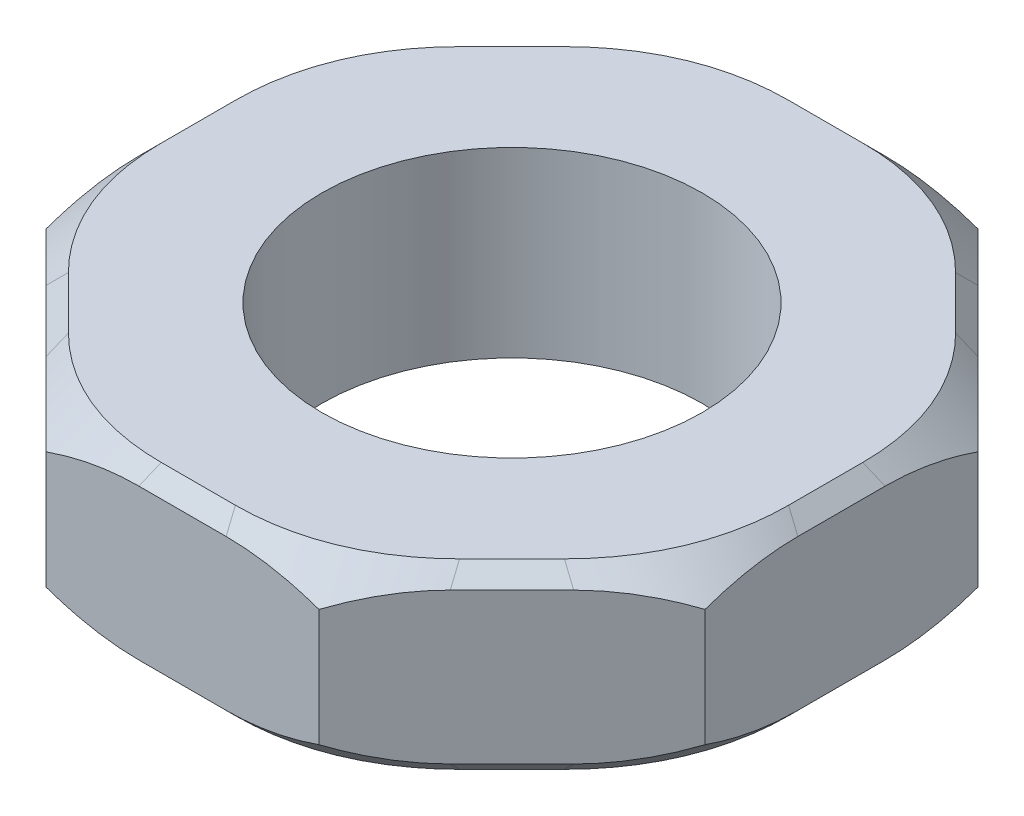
ISO-10303-21;
HEADER;
FILE_DESCRIPTION(('STEP AP214'),'2;1');
FILE_NAME('part.step','',(''),(''),'','','');
FILE_SCHEMA(('AUTOMOTIVE_DESIGN { 1 0 10303 214 1 1 1 1 }'));
ENDSEC;
DATA;
#1=APPLICATION_CONTEXT('core data for automotive mechanical design processes');
#2=APPLICATION_PROTOCOL_DEFINITION('international standard','automotive_design',2000,#1);
#3=PRODUCT_CONTEXT('',#1,'mechanical');
#4=PRODUCT('Part','Part','',(#3));
#5=PRODUCT_RELATED_PRODUCT_CATEGORY('part','',(#4));
#6=PRODUCT_DEFINITION_FORMATION('','',#4);
#7=PRODUCT_DEFINITION_CONTEXT('part definition',#1,'design');
#8=PRODUCT_DEFINITION('design','',#6,#7);
#9=PRODUCT_DEFINITION_SHAPE('','',#8);
#10=(LENGTH_UNIT() NAMED_UNIT(*) SI_UNIT(.MILLI.,.METRE.));
#11=(NAMED_UNIT(*) PLANE_ANGLE_UNIT() SI_UNIT($,.RADIAN.));
#12=(NAMED_UNIT(*) SI_UNIT($,.STERADIAN.) SOLID_ANGLE_UNIT());
#13=UNCERTAINTY_MEASURE_WITH_UNIT(LENGTH_MEASURE(1.E-05),#10,'distance_accuracy_value','');
#14=(GEOMETRIC_REPRESENTATION_CONTEXT(3) GLOBAL_UNCERTAINTY_ASSIGNED_CONTEXT((#13)) GLOBAL_UNIT_ASSIGNED_CONTEXT((#10,
#11,#12)) REPRESENTATION_CONTEXT('',''));
#15=CARTESIAN_POINT('',(0.,0.,0.));
#16=DIRECTION('',(0.,0.,1.));
#17=DIRECTION('',(1.,0.,0.));
#18=AXIS2_PLACEMENT_3D('',#15,#16,#17);
#19=CARTESIAN_POINT('',(0.,11.5,-29.3944288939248));
#20=DIRECTION('',(0.,1.,0.));
#21=DIRECTION('',(0.,0.,1.));
#22=AXIS2_PLACEMENT_3D('',#19,#20,#21);
#23=PLANE('',#22);
#24=DIRECTION('',(1.,0.,0.));
#25=VECTOR('',#24,1.);
#26=CARTESIAN_POINT('',(8.60942889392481,11.5,19.785));
#27=LINE('',#26,#25);
#28=CARTESIAN_POINT('',(-2.33735095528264,11.5,19.785));
#29=VERTEX_POINT('',#28);
#30=CARTESIAN_POINT('',(2.33735095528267,11.5,19.785));
#31=VERTEX_POINT('',#30);
#32=EDGE_CURVE('E316',#29,#31,#27,.T.);
#33=ORIENTED_EDGE('',*,*,#32,.T.);
#34=CARTESIAN_POINT('',(-3.52051342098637,11.5,-8.49927124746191));
#35=DIRECTION('',(0.,1.,0.));
#36=DIRECTION('',(-0.382683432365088,0.,-0.923879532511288));
#37=AXIS2_PLACEMENT_3D('',#34,#35,#36);
#38=ELLIPSE('',#37,29.472515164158,20.);
#39=CARTESIAN_POINT('',(12.3373509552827,11.5,15.642864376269));
#40=VERTEX_POINT('',#39);
#41=EDGE_CURVE('E453',#31,#40,#38,.T.);
#42=ORIENTED_EDGE('',*,*,#41,.T.);
#43=DIRECTION('',(0.707106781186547,0.,-0.707106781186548));
#44=VECTOR('',#43,1.);
#45=CARTESIAN_POINT('',(20.0778932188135,11.5,7.90232211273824));
#46=LINE('',#45,#44);
#47=CARTESIAN_POINT('',(15.6428643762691,11.5,12.3373509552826));
#48=VERTEX_POINT('',#47);
#49=EDGE_CURVE('E320',#40,#48,#46,.T.);
#50=ORIENTED_EDGE('',*,*,#49,.T.);
#51=CARTESIAN_POINT('',(-8.49927124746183,11.5,-3.52051342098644));
#52=DIRECTION('',(0.,1.,0.));
#53=DIRECTION('',(-0.923879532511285,0.,-0.382683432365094));
#54=AXIS2_PLACEMENT_3D('',#51,#52,#53);
#55=ELLIPSE('',#54,29.472515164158,20.);
#56=CARTESIAN_POINT('',(19.785,11.5,2.33735095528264));
#57=VERTEX_POINT('',#56);
#58=EDGE_CURVE('E451',#48,#57,#55,.T.);
#59=ORIENTED_EDGE('',*,*,#58,.T.);
#60=DIRECTION('',(0.,0.,-1.));
#61=VECTOR('',#60,1.);
#62=CARTESIAN_POINT('',(19.785,11.5,-8.60942889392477));
#63=LINE('',#62,#61);
#64=CARTESIAN_POINT('',(19.785,11.5,-2.33735095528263));
#65=VERTEX_POINT('',#64);
#66=EDGE_CURVE('E536',#57,#65,#63,.T.);
#67=ORIENTED_EDGE('',*,*,#66,.T.);
#68=CARTESIAN_POINT('',(-8.49927124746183,11.5,3.52051342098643));
#69=DIRECTION('',(0.,1.,0.));
#70=DIRECTION('',(-0.923879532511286,0.,0.382683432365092));
#71=AXIS2_PLACEMENT_3D('',#68,#69,#70);
#72=ELLIPSE('',#71,29.472515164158,20.);
#73=CARTESIAN_POINT('',(15.6428643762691,11.5,-12.3373509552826));
#74=VERTEX_POINT('',#73);
#75=EDGE_CURVE('E449',#65,#74,#72,.T.);
#76=ORIENTED_EDGE('',*,*,#75,.T.);
#77=DIRECTION('',(-0.707106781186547,0.,-0.707106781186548));
#78=VECTOR('',#77,1.);
#79=CARTESIAN_POINT('',(7.90232211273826,11.5,-20.0778932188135));
#80=LINE('',#79,#78);
#81=CARTESIAN_POINT('',(12.3373509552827,11.5,-15.642864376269));
#82=VERTEX_POINT('',#81);
#83=EDGE_CURVE('E533',#74,#82,#80,.T.);
#84=ORIENTED_EDGE('',*,*,#83,.T.);
#85=CARTESIAN_POINT('',(-3.52051342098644,11.5,8.49927124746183));
#86=DIRECTION('',(0.,1.,0.));
#87=DIRECTION('',(-0.382683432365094,0.,0.923879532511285));
#88=AXIS2_PLACEMENT_3D('',#85,#86,#87);
#89=ELLIPSE('',#88,29.472515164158,20.);
#90=CARTESIAN_POINT('',(2.33735095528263,11.5,-19.785));
#91=VERTEX_POINT('',#90);
#92=EDGE_CURVE('E447',#82,#91,#89,.T.);
#93=ORIENTED_EDGE('',*,*,#92,.T.);
#94=DIRECTION('',(-1.,0.,0.));
#95=VECTOR('',#94,1.);
#96=CARTESIAN_POINT('',(-8.6094288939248,11.5,-19.785));
#97=LINE('',#96,#95);
#98=CARTESIAN_POINT('',(-2.33735095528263,11.5,-19.785));
#99=VERTEX_POINT('',#98);
#100=EDGE_CURVE('E530',#91,#99,#97,.T.);
#101=ORIENTED_EDGE('',*,*,#100,.T.);
#102=CARTESIAN_POINT('',(3.52051342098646,11.5,8.49927124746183));
#103=DIRECTION('',(0.,1.,0.));
#104=DIRECTION('',(-0.382683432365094,0.,-0.923879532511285));
#105=AXIS2_PLACEMENT_3D('',#102,#103,#104);
#106=ELLIPSE('',#105,29.472515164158,20.);
#107=CARTESIAN_POINT('',(-12.3373509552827,11.5,-15.642864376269));
#108=VERTEX_POINT('',#107);
#109=EDGE_CURVE('E445',#99,#108,#106,.T.);
#110=ORIENTED_EDGE('',*,*,#109,.T.);
#111=DIRECTION('',(-0.707106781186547,0.,0.707106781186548));
#112=VECTOR('',#111,1.);
#113=CARTESIAN_POINT('',(-20.0778932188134,11.5,-7.90232211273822));
#114=LINE('',#113,#112);
#115=CARTESIAN_POINT('',(-15.642864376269,11.5,-12.3373509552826));
#116=VERTEX_POINT('',#115);
#117=EDGE_CURVE('E528',#108,#116,#114,.T.);
#118=ORIENTED_EDGE('',*,*,#117,.T.);
#119=CARTESIAN_POINT('',(8.49927124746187,11.5,3.52051342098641));
#120=DIRECTION('',(0.,1.,0.));
#121=DIRECTION('',(-0.923879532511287,0.,-0.382683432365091));
#122=AXIS2_PLACEMENT_3D('',#119,#120,#121);
#123=ELLIPSE('',#122,29.472515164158,20.);
#124=CARTESIAN_POINT('',(-19.785,11.5,-2.33735095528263));
#125=VERTEX_POINT('',#124);
#126=EDGE_CURVE('E52',#116,#125,#123,.T.);
#127=ORIENTED_EDGE('',*,*,#126,.T.);
#128=DIRECTION('',(0.,0.,1.));
#129=VECTOR('',#128,1.);
#130=CARTESIAN_POINT('',(-19.785,11.5,8.60942889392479));
#131=LINE('',#130,#129);
#132=CARTESIAN_POINT('',(-19.785,11.5,2.33735095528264));
#133=VERTEX_POINT('',#132);
#134=EDGE_CURVE('E498',#125,#133,#131,.T.);
#135=ORIENTED_EDGE('',*,*,#134,.T.);
#136=CARTESIAN_POINT('',(8.49927124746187,11.5,-3.52051342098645));
#137=DIRECTION('',(0.,1.,0.));
#138=DIRECTION('',(-0.923879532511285,0.,0.382683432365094));
#139=AXIS2_PLACEMENT_3D('',#136,#137,#138);
#140=ELLIPSE('',#139,29.472515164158,20.);
#141=CARTESIAN_POINT('',(-15.642864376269,11.5,12.3373509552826));
#142=VERTEX_POINT('',#141);
#143=EDGE_CURVE('E442',#133,#142,#140,.T.);
#144=ORIENTED_EDGE('',*,*,#143,.T.);
#145=DIRECTION('',(0.707106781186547,0.,0.707106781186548));
#146=VECTOR('',#145,1.);
#147=CARTESIAN_POINT('',(-7.90232211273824,11.5,20.0778932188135));
#148=LINE('',#147,#146);
#149=CARTESIAN_POINT('',(-12.3373509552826,11.5,15.642864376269));
#150=VERTEX_POINT('',#149);
#151=EDGE_CURVE('E488',#142,#150,#148,.T.);
#152=ORIENTED_EDGE('',*,*,#151,.T.);
#153=CARTESIAN_POINT('',(3.52051342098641,11.5,-8.49927124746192));
#154=DIRECTION('',(0.,1.,0.));
#155=DIRECTION('',(-0.382683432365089,0.,0.923879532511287));
#156=AXIS2_PLACEMENT_3D('',#153,#154,#155);
#157=ELLIPSE('',#156,29.472515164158,20.);
#158=EDGE_CURVE('E440',#150,#29,#157,.T.);
#159=ORIENTED_EDGE('',*,*,#158,.T.);
#160=EDGE_LOOP('',(#33,#42,#50,#59,#67,#76,#84,#93,#101,#110,#118,#127,#135,#144,#152,#159));
#161=FACE_BOUND('',#160,.T.);
#162=CARTESIAN_POINT('',(0.,11.5,0.));
#163=DIRECTION('',(0.,1.,0.));
#164=DIRECTION('',(0.,0.,1.));
#165=AXIS2_PLACEMENT_3D('',#162,#163,#164);
#166=CIRCLE('',#165,12.);
#167=CARTESIAN_POINT('',(0.,11.5,12.));
#168=VERTEX_POINT('',#167);
#169=EDGE_CURVE('E651',#168,#168,#166,.T.);
#170=ORIENTED_EDGE('',*,*,#169,.F.);
#171=EDGE_LOOP('',(#170));
#172=FACE_BOUND('',#171,.T.);
#173=ADVANCED_FACE('F30',(#161,#172),#23,.T.);
#174=CARTESIAN_POINT('',(0.,0.,-29.3944288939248));
#175=DIRECTION('',(0.,1.,0.));
#176=DIRECTION('',(0.,0.,1.));
#177=AXIS2_PLACEMENT_3D('',#174,#175,#176);
#178=PLANE('',#177);
#179=DIRECTION('',(1.,0.,0.));
#180=VECTOR('',#179,1.);
#181=CARTESIAN_POINT('',(0.,0.,-19.785));
#182=LINE('',#181,#180);
#183=CARTESIAN_POINT('',(-2.33735095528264,0.,-19.785));
#184=VERTEX_POINT('',#183);
#185=CARTESIAN_POINT('',(2.33735095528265,0.,-19.785));
#186=VERTEX_POINT('',#185);
#187=EDGE_CURVE('E293',#184,#186,#182,.T.);
#188=ORIENTED_EDGE('',*,*,#187,.T.);
#189=CARTESIAN_POINT('',(-3.52051342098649,0.,8.49927124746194));
#190=DIRECTION('',(0.,1.,0.));
#191=DIRECTION('',(-0.382683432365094,0.,0.923879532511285));
#192=AXIS2_PLACEMENT_3D('',#189,#190,#191);
#193=ELLIPSE('',#192,29.4725151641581,20.);
#194=CARTESIAN_POINT('',(12.3373509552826,0.,-15.642864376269));
#195=VERTEX_POINT('',#194);
#196=EDGE_CURVE('E335',#186,#195,#193,.F.);
#197=ORIENTED_EDGE('',*,*,#196,.T.);
#198=DIRECTION('',(0.707106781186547,0.,0.707106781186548));
#199=VECTOR('',#198,1.);
#200=CARTESIAN_POINT('',(-0.707106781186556,0.,-28.6873221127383));
#201=LINE('',#200,#199);
#202=CARTESIAN_POINT('',(15.6428643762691,0.,-12.3373509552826));
#203=VERTEX_POINT('',#202);
#204=EDGE_CURVE('E310',#195,#203,#201,.T.);
#205=ORIENTED_EDGE('',*,*,#204,.T.);
#206=CARTESIAN_POINT('',(-8.49927124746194,0.,3.52051342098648));
#207=DIRECTION('',(0.,1.,0.));
#208=DIRECTION('',(-0.923879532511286,0.,0.382683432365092));
#209=AXIS2_PLACEMENT_3D('',#206,#207,#208);
#210=ELLIPSE('',#209,29.4725151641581,20.);
#211=CARTESIAN_POINT('',(19.785,0.,-2.33735095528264));
#212=VERTEX_POINT('',#211);
#213=EDGE_CURVE('E333',#203,#212,#210,.F.);
#214=ORIENTED_EDGE('',*,*,#213,.T.);
#215=DIRECTION('',(0.,0.,1.));
#216=VECTOR('',#215,1.);
#217=CARTESIAN_POINT('',(19.785,0.,-29.3944288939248));
#218=LINE('',#217,#216);
#219=CARTESIAN_POINT('',(19.785,0.,2.33735095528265));
#220=VERTEX_POINT('',#219);
#221=EDGE_CURVE('E585',#212,#220,#218,.T.);
#222=ORIENTED_EDGE('',*,*,#221,.T.);
#223=CARTESIAN_POINT('',(-8.49927124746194,0.,-3.52051342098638));
#224=DIRECTION('',(0.,1.,0.));
#225=DIRECTION('',(0.923879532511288,0.,0.382683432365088));
#226=AXIS2_PLACEMENT_3D('',#223,#224,#225);
#227=ELLIPSE('',#226,29.472515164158,20.);
#228=CARTESIAN_POINT('',(15.6428643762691,0.,12.3373509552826));
#229=VERTEX_POINT('',#228);
#230=EDGE_CURVE('E331',#220,#229,#227,.F.);
#231=ORIENTED_EDGE('',*,*,#230,.T.);
#232=DIRECTION('',(-0.707106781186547,0.,0.707106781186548));
#233=VECTOR('',#232,1.);
#234=CARTESIAN_POINT('',(28.6873221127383,0.,-0.707106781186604));
#235=LINE('',#234,#233);
#236=CARTESIAN_POINT('',(12.3373509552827,0.,15.642864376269));
#237=VERTEX_POINT('',#236);
#238=EDGE_CURVE('E582',#229,#237,#235,.T.);
#239=ORIENTED_EDGE('',*,*,#238,.T.);
#240=CARTESIAN_POINT('',(-3.52051342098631,0.,-8.49927124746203));
#241=DIRECTION('',(0.,1.,0.));
#242=DIRECTION('',(0.382683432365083,0.,0.92387953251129));
#243=AXIS2_PLACEMENT_3D('',#240,#241,#242);
#244=ELLIPSE('',#243,29.4725151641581,20.);
#245=CARTESIAN_POINT('',(2.33735095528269,0.,19.785));
#246=VERTEX_POINT('',#245);
#247=EDGE_CURVE('E329',#237,#246,#244,.F.);
#248=ORIENTED_EDGE('',*,*,#247,.T.);
#249=DIRECTION('',(-1.,0.,0.));
#250=VECTOR('',#249,1.);
#251=CARTESIAN_POINT('',(0.,0.,19.785));
#252=LINE('',#251,#250);
#253=CARTESIAN_POINT('',(-2.33735095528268,0.,19.785));
#254=VERTEX_POINT('',#253);
#255=EDGE_CURVE('E579',#246,#254,#252,.T.);
#256=ORIENTED_EDGE('',*,*,#255,.T.);
#257=CARTESIAN_POINT('',(3.52051342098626,0.,-8.49927124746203));
#258=DIRECTION('',(0.,1.,0.));
#259=DIRECTION('',(-0.38268343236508,0.,0.923879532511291));
#260=AXIS2_PLACEMENT_3D('',#257,#258,#259);
#261=ELLIPSE('',#260,29.4725151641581,20.);
#262=CARTESIAN_POINT('',(-12.3373509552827,0.,15.642864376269));
#263=VERTEX_POINT('',#262);
#264=EDGE_CURVE('E327',#254,#263,#261,.F.);
#265=ORIENTED_EDGE('',*,*,#264,.T.);
#266=DIRECTION('',(-0.707106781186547,0.,-0.707106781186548));
#267=VECTOR('',#266,1.);
#268=CARTESIAN_POINT('',(-28.6873221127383,0.,-0.707106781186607));
#269=LINE('',#268,#267);
#270=CARTESIAN_POINT('',(-15.642864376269,0.,12.3373509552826));
#271=VERTEX_POINT('',#270);
#272=EDGE_CURVE('E576',#263,#271,#269,.T.);
#273=ORIENTED_EDGE('',*,*,#272,.T.);
#274=CARTESIAN_POINT('',(8.49927124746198,0.,-3.52051342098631));
#275=DIRECTION('',(0.,1.,0.));
#276=DIRECTION('',(-0.923879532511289,0.,0.382683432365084));
#277=AXIS2_PLACEMENT_3D('',#274,#275,#276);
#278=ELLIPSE('',#277,29.472515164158,20.);
#279=CARTESIAN_POINT('',(-19.785,0.,2.33735095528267));
#280=VERTEX_POINT('',#279);
#281=EDGE_CURVE('E325',#271,#280,#278,.F.);
#282=ORIENTED_EDGE('',*,*,#281,.T.);
#283=DIRECTION('',(0.,0.,-1.));
#284=VECTOR('',#283,1.);
#285=CARTESIAN_POINT('',(-19.785,0.,-29.3944288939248));
#286=LINE('',#285,#284);
#287=CARTESIAN_POINT('',(-19.785,0.,-2.33735095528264));
#288=VERTEX_POINT('',#287);
#289=EDGE_CURVE('E591',#280,#288,#286,.T.);
#290=ORIENTED_EDGE('',*,*,#289,.T.);
#291=CARTESIAN_POINT('',(8.49927124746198,0.,3.52051342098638));
#292=DIRECTION('',(0.,1.,0.));
#293=DIRECTION('',(0.923879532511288,0.,0.382683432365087));
#294=AXIS2_PLACEMENT_3D('',#291,#292,#293);
#295=ELLIPSE('',#294,29.4725151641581,20.);
#296=CARTESIAN_POINT('',(-15.642864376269,0.,-12.3373509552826));
#297=VERTEX_POINT('',#296);
#298=EDGE_CURVE('E300',#288,#297,#295,.F.);
#299=ORIENTED_EDGE('',*,*,#298,.T.);
#300=DIRECTION('',(0.707106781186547,0.,-0.707106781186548));
#301=VECTOR('',#300,1.);
#302=CARTESIAN_POINT('',(0.70710678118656,0.,-28.6873221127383));
#303=LINE('',#302,#301);
#304=CARTESIAN_POINT('',(-12.3373509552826,0.,-15.642864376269));
#305=VERTEX_POINT('',#304);
#306=EDGE_CURVE('E295',#297,#305,#303,.T.);
#307=ORIENTED_EDGE('',*,*,#306,.T.);
#308=CARTESIAN_POINT('',(3.52051342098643,0.,8.49927124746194));
#309=DIRECTION('',(0.,1.,0.));
#310=DIRECTION('',(0.38268343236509,0.,0.923879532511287));
#311=AXIS2_PLACEMENT_3D('',#308,#309,#310);
#312=ELLIPSE('',#311,29.472515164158,20.);
#313=EDGE_CURVE('E289',#305,#184,#312,.F.);
#314=ORIENTED_EDGE('',*,*,#313,.T.);
#315=EDGE_LOOP('',(#188,#197,#205,#214,#222,#231,#239,#248,#256,#265,#273,#282,#290,#299,#307,#314));
#316=FACE_BOUND('',#315,.T.);
#317=CARTESIAN_POINT('',(0.,0.,0.));
#318=DIRECTION('',(0.,1.,0.));
#319=DIRECTION('',(0.,0.,1.));
#320=AXIS2_PLACEMENT_3D('',#317,#318,#319);
#321=CIRCLE('',#320,12.);
#322=CARTESIAN_POINT('',(0.,0.,12.));
#323=VERTEX_POINT('',#322);
#324=EDGE_CURVE('E654',#323,#323,#321,.T.);
#325=ORIENTED_EDGE('',*,*,#324,.T.);
#326=EDGE_LOOP('',(#325));
#327=FACE_BOUND('',#326,.T.);
#328=ADVANCED_FACE('F291',(#316,#327),#178,.F.);
#329=CARTESIAN_POINT('',(-20.785,11.5,-8.60942889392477));
#330=DIRECTION('',(0.707106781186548,0.,0.707106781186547));
#331=DIRECTION('',(0.707106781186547,0.,-0.707106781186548));
#332=AXIS2_PLACEMENT_3D('',#329,#330,#331);
#333=PLANE('',#332);
#334=DIRECTION('',(-0.707106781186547,0.,0.707106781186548));
#335=VECTOR('',#334,1.);
#336=CARTESIAN_POINT('',(-20.785,1.00000000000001,-8.60942889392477));
#337=LINE('',#336,#335);
#338=CARTESIAN_POINT('',(-12.7515645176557,1.00000000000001,-16.642864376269));
#339=VERTEX_POINT('',#338);
#340=CARTESIAN_POINT('',(-16.6428643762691,1.00000000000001,-12.7515645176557));
#341=VERTEX_POINT('',#340);
#342=EDGE_CURVE('E597',#339,#341,#337,.T.);
#343=ORIENTED_EDGE('',*,*,#342,.T.);
#344=CARTESIAN_POINT('',(-20.785,29.2842712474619,-8.60942889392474));
#345=DIRECTION('',(0.707106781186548,0.,0.707106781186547));
#346=DIRECTION('',(0.2705980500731,-0.923879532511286,-0.270598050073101));
#347=AXIS2_PLACEMENT_3D('',#344,#345,#346);
#348=ELLIPSE('',#347,29.472515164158,20.);
#349=CARTESIAN_POINT('',(-20.785,2.05521771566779,-8.60942889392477));
#350=VERTEX_POINT('',#349);
#351=EDGE_CURVE('E432',#341,#350,#348,.F.);
#352=ORIENTED_EDGE('',*,*,#351,.T.);
#353=DIRECTION('',(0.,-1.,0.));
#354=VECTOR('',#353,1.);
#355=CARTESIAN_POINT('',(-20.785,11.5,-8.60942889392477));
#356=LINE('',#355,#354);
#357=CARTESIAN_POINT('',(-20.785,9.44478228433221,-8.60942889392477));
#358=VERTEX_POINT('',#357);
#359=EDGE_CURVE('E567',#358,#350,#356,.T.);
#360=ORIENTED_EDGE('',*,*,#359,.F.);
#361=CARTESIAN_POINT('',(-20.785,-17.7842712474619,-8.60942889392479));
#362=DIRECTION('',(0.707106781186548,0.,0.707106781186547));
#363=DIRECTION('',(-0.270598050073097,-0.923879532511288,0.270598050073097));
#364=AXIS2_PLACEMENT_3D('',#361,#362,#363);
#365=ELLIPSE('',#364,29.472515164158,20.);
#366=CARTESIAN_POINT('',(-16.642864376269,10.5,-12.7515645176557));
#367=VERTEX_POINT('',#366);
#368=EDGE_CURVE('E426',#358,#367,#365,.F.);
#369=ORIENTED_EDGE('',*,*,#368,.T.);
#370=DIRECTION('',(0.707106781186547,0.,-0.707106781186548));
#371=VECTOR('',#370,1.);
#372=CARTESIAN_POINT('',(-8.60942889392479,10.5,-20.785));
#373=LINE('',#372,#371);
#374=CARTESIAN_POINT('',(-12.7515645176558,10.5,-16.642864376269));
#375=VERTEX_POINT('',#374);
#376=EDGE_CURVE('E594',#367,#375,#373,.T.);
#377=ORIENTED_EDGE('',*,*,#376,.T.);
#378=CARTESIAN_POINT('',(-8.60942889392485,-17.7842712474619,-20.7849999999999));
#379=DIRECTION('',(0.707106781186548,0.,0.707106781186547));
#380=DIRECTION('',(0.270598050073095,-0.923879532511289,-0.270598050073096));
#381=AXIS2_PLACEMENT_3D('',#378,#379,#380);
#382=ELLIPSE('',#381,29.472515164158,20.);
#383=CARTESIAN_POINT('',(-8.6094288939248,9.44478228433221,-20.785));
#384=VERTEX_POINT('',#383);
#385=EDGE_CURVE('E428',#375,#384,#382,.F.);
#386=ORIENTED_EDGE('',*,*,#385,.T.);
#387=DIRECTION('',(0.,-1.,0.));
#388=VECTOR('',#387,1.);
#389=CARTESIAN_POINT('',(-8.6094288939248,11.5,-20.785));
#390=LINE('',#389,#388);
#391=CARTESIAN_POINT('',(-8.6094288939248,2.05521771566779,-20.785));
#392=VERTEX_POINT('',#391);
#393=EDGE_CURVE('E648',#384,#392,#390,.T.);
#394=ORIENTED_EDGE('',*,*,#393,.T.);
#395=CARTESIAN_POINT('',(-8.6094288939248,29.2842712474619,-20.785));
#396=DIRECTION('',(0.707106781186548,0.,0.707106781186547));
#397=DIRECTION('',(-0.270598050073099,-0.923879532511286,0.270598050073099));
#398=AXIS2_PLACEMENT_3D('',#395,#396,#397);
#399=ELLIPSE('',#398,29.472515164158,20.);
#400=EDGE_CURVE('E430',#392,#339,#399,.F.);
#401=ORIENTED_EDGE('',*,*,#400,.T.);
#402=EDGE_LOOP('',(#343,#352,#360,#369,#377,#386,#394,#401));
#403=FACE_BOUND('',#402,.T.);
#404=ADVANCED_FACE('F667',(#403),#333,.F.);
#405=CARTESIAN_POINT('',(-20.785,11.5,-8.60942889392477));
#406=DIRECTION('',(1.,0.,0.));
#407=DIRECTION('',(0.,0.,-1.));
#408=AXIS2_PLACEMENT_3D('',#405,#406,#407);
#409=PLANE('',#408);
#410=DIRECTION('',(0.,0.,1.));
#411=VECTOR('',#410,1.);
#412=CARTESIAN_POINT('',(-20.785,1.00000000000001,-8.60942889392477));
#413=LINE('',#412,#411);
#414=CARTESIAN_POINT('',(-20.785,1.00000000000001,-2.75156451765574));
#415=VERTEX_POINT('',#414);
#416=CARTESIAN_POINT('',(-20.785,1.00000000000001,2.75156451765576));
#417=VERTEX_POINT('',#416);
#418=EDGE_CURVE('E573',#415,#417,#413,.T.);
#419=ORIENTED_EDGE('',*,*,#418,.T.);
#420=CARTESIAN_POINT('',(-20.785,29.2842712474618,8.60942889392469));
#421=DIRECTION('',(1.,0.,0.));
#422=DIRECTION('',(0.,0.923879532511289,0.382683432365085));
#423=AXIS2_PLACEMENT_3D('',#420,#421,#422);
#424=ELLIPSE('',#423,29.4725151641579,20.);
#425=CARTESIAN_POINT('',(-20.785,2.05521771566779,8.60942889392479));
#426=VERTEX_POINT('',#425);
#427=EDGE_CURVE('E420',#417,#426,#424,.F.);
#428=ORIENTED_EDGE('',*,*,#427,.T.);
#429=DIRECTION('',(0.,-1.,0.));
#430=VECTOR('',#429,1.);
#431=CARTESIAN_POINT('',(-20.785,11.5,8.60942889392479));
#432=LINE('',#431,#430);
#433=CARTESIAN_POINT('',(-20.785,9.44478228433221,8.60942889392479));
#434=VERTEX_POINT('',#433);
#435=EDGE_CURVE('E558',#434,#426,#432,.T.);
#436=ORIENTED_EDGE('',*,*,#435,.F.);
#437=CARTESIAN_POINT('',(-20.785,-17.7842712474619,8.60942889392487));
#438=DIRECTION('',(1.,0.,0.));
#439=DIRECTION('',(0.,-0.923879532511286,0.382683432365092));
#440=AXIS2_PLACEMENT_3D('',#437,#438,#439);
#441=ELLIPSE('',#440,29.4725151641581,20.);
#442=CARTESIAN_POINT('',(-20.785,10.5,2.75156451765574));
#443=VERTEX_POINT('',#442);
#444=EDGE_CURVE('E414',#434,#443,#441,.F.);
#445=ORIENTED_EDGE('',*,*,#444,.T.);
#446=DIRECTION('',(0.,0.,-1.));
#447=VECTOR('',#446,1.);
#448=CARTESIAN_POINT('',(-20.785,10.5,-8.60942889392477));
#449=LINE('',#448,#447);
#450=CARTESIAN_POINT('',(-20.785,10.5,-2.75156451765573));
#451=VERTEX_POINT('',#450);
#452=EDGE_CURVE('E570',#443,#451,#449,.T.);
#453=ORIENTED_EDGE('',*,*,#452,.T.);
#454=CARTESIAN_POINT('',(-20.785,-17.7842712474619,-8.60942889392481));
#455=DIRECTION('',(1.,0.,0.));
#456=DIRECTION('',(0.,-0.923879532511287,-0.38268343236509));
#457=AXIS2_PLACEMENT_3D('',#454,#455,#456);
#458=ELLIPSE('',#457,29.4725151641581,20.);
#459=EDGE_CURVE('E416',#451,#358,#458,.F.);
#460=ORIENTED_EDGE('',*,*,#459,.T.);
#461=ORIENTED_EDGE('',*,*,#359,.T.);
#462=CARTESIAN_POINT('',(-20.785,29.2842712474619,-8.60942889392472));
#463=DIRECTION('',(1.,0.,0.));
#464=DIRECTION('',(0.,-0.923879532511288,0.382683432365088));
#465=AXIS2_PLACEMENT_3D('',#462,#463,#464);
#466=ELLIPSE('',#465,29.4725151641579,20.);
#467=EDGE_CURVE('E418',#350,#415,#466,.F.);
#468=ORIENTED_EDGE('',*,*,#467,.T.);
#469=EDGE_LOOP('',(#419,#428,#436,#445,#453,#460,#461,#468));
#470=FACE_BOUND('',#469,.T.);
#471=ADVANCED_FACE('F684',(#470),#409,.F.);
#472=CARTESIAN_POINT('',(-20.785,11.5,8.60942889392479));
#473=DIRECTION('',(0.707106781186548,0.,-0.707106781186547));
#474=DIRECTION('',(-0.707106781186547,0.,-0.707106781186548));
#475=AXIS2_PLACEMENT_3D('',#472,#473,#474);
#476=PLANE('',#475);
#477=DIRECTION('',(0.707106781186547,0.,0.707106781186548));
#478=VECTOR('',#477,1.);
#479=CARTESIAN_POINT('',(-20.785,1.00000000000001,8.60942889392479));
#480=LINE('',#479,#478);
#481=CARTESIAN_POINT('',(-16.6428643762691,1.00000000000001,12.7515645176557));
#482=VERTEX_POINT('',#481);
#483=CARTESIAN_POINT('',(-12.7515645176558,1.00000000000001,16.642864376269));
#484=VERTEX_POINT('',#483);
#485=EDGE_CURVE('E499',#482,#484,#480,.T.);
#486=ORIENTED_EDGE('',*,*,#485,.T.);
#487=CARTESIAN_POINT('',(-8.60942889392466,29.2842712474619,20.7850000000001));
#488=DIRECTION('',(0.707106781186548,0.,-0.707106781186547));
#489=DIRECTION('',(0.270598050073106,0.923879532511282,0.270598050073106));
#490=AXIS2_PLACEMENT_3D('',#487,#488,#489);
#491=ELLIPSE('',#490,29.4725151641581,20.);
#492=CARTESIAN_POINT('',(-8.60942889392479,2.05521771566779,20.785));
#493=VERTEX_POINT('',#492);
#494=EDGE_CURVE('E406',#484,#493,#491,.F.);
#495=ORIENTED_EDGE('',*,*,#494,.T.);
#496=DIRECTION('',(0.,-1.,0.));
#497=VECTOR('',#496,1.);
#498=CARTESIAN_POINT('',(-8.60942889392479,11.5,20.785));
#499=LINE('',#498,#497);
#500=CARTESIAN_POINT('',(-8.60942889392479,9.44478228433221,20.785));
#501=VERTEX_POINT('',#500);
#502=EDGE_CURVE('E555',#501,#493,#499,.T.);
#503=ORIENTED_EDGE('',*,*,#502,.F.);
#504=CARTESIAN_POINT('',(-8.60942889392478,-17.7842712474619,20.785));
#505=DIRECTION('',(0.707106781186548,0.,-0.707106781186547));
#506=DIRECTION('',(0.2705980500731,-0.923879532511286,0.2705980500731));
#507=AXIS2_PLACEMENT_3D('',#504,#505,#506);
#508=ELLIPSE('',#507,29.472515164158,20.);
#509=CARTESIAN_POINT('',(-12.7515645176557,10.5,16.6428643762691));
#510=VERTEX_POINT('',#509);
#511=EDGE_CURVE('E400',#501,#510,#508,.F.);
#512=ORIENTED_EDGE('',*,*,#511,.T.);
#513=DIRECTION('',(-0.707106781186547,0.,-0.707106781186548));
#514=VECTOR('',#513,1.);
#515=CARTESIAN_POINT('',(-20.785,10.5,8.60942889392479));
#516=LINE('',#515,#514);
#517=CARTESIAN_POINT('',(-16.6428643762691,10.5,12.7515645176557));
#518=VERTEX_POINT('',#517);
#519=EDGE_CURVE('E491',#510,#518,#516,.T.);
#520=ORIENTED_EDGE('',*,*,#519,.T.);
#521=CARTESIAN_POINT('',(-20.7849999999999,-17.7842712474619,8.60942889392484));
#522=DIRECTION('',(0.707106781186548,0.,-0.707106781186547));
#523=DIRECTION('',(-0.270598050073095,-0.923879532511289,-0.270598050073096));
#524=AXIS2_PLACEMENT_3D('',#521,#522,#523);
#525=ELLIPSE('',#524,29.472515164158,20.);
#526=EDGE_CURVE('E402',#518,#434,#525,.F.);
#527=ORIENTED_EDGE('',*,*,#526,.T.);
#528=ORIENTED_EDGE('',*,*,#435,.T.);
#529=CARTESIAN_POINT('',(-20.7850000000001,29.2842712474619,8.60942889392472));
#530=DIRECTION('',(0.707106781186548,0.,-0.707106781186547));
#531=DIRECTION('',(-0.270598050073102,0.923879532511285,-0.270598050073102));
#532=AXIS2_PLACEMENT_3D('',#529,#530,#531);
#533=ELLIPSE('',#532,29.4725151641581,20.);
#534=EDGE_CURVE('E404',#426,#482,#533,.F.);
#535=ORIENTED_EDGE('',*,*,#534,.T.);
#536=EDGE_LOOP('',(#486,#495,#503,#512,#520,#527,#528,#535));
#537=FACE_BOUND('',#536,.T.);
#538=ADVANCED_FACE('F681',(#537),#476,.F.);
#539=CARTESIAN_POINT('',(-8.60942889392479,11.5,20.785));
#540=DIRECTION('',(0.,0.,-1.));
#541=DIRECTION('',(-1.,0.,0.));
#542=AXIS2_PLACEMENT_3D('',#539,#540,#541);
#543=PLANE('',#542);
#544=DIRECTION('',(1.,0.,0.));
#545=VECTOR('',#544,1.);
#546=CARTESIAN_POINT('',(-8.60942889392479,1.00000000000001,20.785));
#547=LINE('',#546,#545);
#548=CARTESIAN_POINT('',(-2.75156451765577,1.00000000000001,20.785));
#549=VERTEX_POINT('',#548);
#550=CARTESIAN_POINT('',(2.75156451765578,1.00000000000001,20.785));
#551=VERTEX_POINT('',#550);
#552=EDGE_CURVE('E515',#549,#551,#547,.T.);
#553=ORIENTED_EDGE('',*,*,#552,.T.);
#554=CARTESIAN_POINT('',(8.60942889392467,29.2842712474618,20.785));
#555=DIRECTION('',(0.,0.,-1.));
#556=DIRECTION('',(0.382683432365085,0.923879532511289,0.));
#557=AXIS2_PLACEMENT_3D('',#554,#555,#556);
#558=ELLIPSE('',#557,29.4725151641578,20.);
#559=CARTESIAN_POINT('',(8.60942889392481,2.05521771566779,20.785));
#560=VERTEX_POINT('',#559);
#561=EDGE_CURVE('E393',#551,#560,#558,.F.);
#562=ORIENTED_EDGE('',*,*,#561,.T.);
#563=DIRECTION('',(0.,-1.,0.));
#564=VECTOR('',#563,1.);
#565=CARTESIAN_POINT('',(8.60942889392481,11.5,20.785));
#566=LINE('',#565,#564);
#567=CARTESIAN_POINT('',(8.60942889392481,9.44478228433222,20.785));
#568=VERTEX_POINT('',#567);
#569=EDGE_CURVE('E553',#568,#560,#566,.T.);
#570=ORIENTED_EDGE('',*,*,#569,.F.);
#571=CARTESIAN_POINT('',(8.60942889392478,-17.7842712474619,20.785));
#572=DIRECTION('',(0.,0.,-1.));
#573=DIRECTION('',(-0.382683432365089,0.923879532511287,0.));
#574=AXIS2_PLACEMENT_3D('',#571,#572,#573);
#575=ELLIPSE('',#574,29.472515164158,20.);
#576=CARTESIAN_POINT('',(2.75156451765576,10.5,20.785));
#577=VERTEX_POINT('',#576);
#578=EDGE_CURVE('E389',#568,#577,#575,.F.);
#579=ORIENTED_EDGE('',*,*,#578,.T.);
#580=DIRECTION('',(-1.,0.,0.));
#581=VECTOR('',#580,1.);
#582=CARTESIAN_POINT('',(-8.60942889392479,10.5,20.785));
#583=LINE('',#582,#581);
#584=CARTESIAN_POINT('',(-2.75156451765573,10.5,20.785));
#585=VERTEX_POINT('',#584);
#586=EDGE_CURVE('E506',#577,#585,#583,.T.);
#587=ORIENTED_EDGE('',*,*,#586,.T.);
#588=CARTESIAN_POINT('',(-8.60942889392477,-17.7842712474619,20.785));
#589=DIRECTION('',(0.,0.,-1.));
#590=DIRECTION('',(-0.38268343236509,-0.923879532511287,0.));
#591=AXIS2_PLACEMENT_3D('',#588,#589,#590);
#592=ELLIPSE('',#591,29.472515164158,20.);
#593=EDGE_CURVE('E387',#585,#501,#592,.F.);
#594=ORIENTED_EDGE('',*,*,#593,.T.);
#595=ORIENTED_EDGE('',*,*,#502,.T.);
#596=CARTESIAN_POINT('',(-8.60942889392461,29.2842712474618,20.785));
#597=DIRECTION('',(0.,0.,-1.));
#598=DIRECTION('',(-0.382683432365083,0.92387953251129,0.));
#599=AXIS2_PLACEMENT_3D('',#596,#597,#598);
#600=ELLIPSE('',#599,29.4725151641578,20.);
#601=EDGE_CURVE('E391',#493,#549,#600,.F.);
#602=ORIENTED_EDGE('',*,*,#601,.T.);
#603=EDGE_LOOP('',(#553,#562,#570,#579,#587,#594,#595,#602));
#604=FACE_BOUND('',#603,.T.);
#605=ADVANCED_FACE('F510',(#604),#543,.F.);
#606=CARTESIAN_POINT('',(20.785,11.5,8.60942889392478));
#607=DIRECTION('',(-0.707106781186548,0.,-0.707106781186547));
#608=DIRECTION('',(-0.707106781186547,0.,0.707106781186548));
#609=AXIS2_PLACEMENT_3D('',#606,#607,#608);
#610=PLANE('',#609);
#611=DIRECTION('',(0.707106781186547,0.,-0.707106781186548));
#612=VECTOR('',#611,1.);
#613=CARTESIAN_POINT('',(20.785,1.00000000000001,8.60942889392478));
#614=LINE('',#613,#612);
#615=CARTESIAN_POINT('',(12.7515645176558,1.00000000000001,16.642864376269));
#616=VERTEX_POINT('',#615);
#617=CARTESIAN_POINT('',(16.6428643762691,1.00000000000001,12.7515645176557));
#618=VERTEX_POINT('',#617);
#619=EDGE_CURVE('E516',#616,#618,#614,.T.);
#620=ORIENTED_EDGE('',*,*,#619,.T.);
#621=CARTESIAN_POINT('',(20.785,29.2842712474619,8.60942889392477));
#622=DIRECTION('',(-0.707106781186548,0.,-0.707106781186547));
#623=DIRECTION('',(0.270598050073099,0.923879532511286,-0.2705980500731));
#624=AXIS2_PLACEMENT_3D('',#621,#622,#623);
#625=ELLIPSE('',#624,29.472515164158,20.);
#626=CARTESIAN_POINT('',(20.785,2.05521771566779,8.60942889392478));
#627=VERTEX_POINT('',#626);
#628=EDGE_CURVE('E380',#618,#627,#625,.F.);
#629=ORIENTED_EDGE('',*,*,#628,.T.);
#630=DIRECTION('',(0.,-1.,0.));
#631=VECTOR('',#630,1.);
#632=CARTESIAN_POINT('',(20.785,11.5,8.60942889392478));
#633=LINE('',#632,#631);
#634=CARTESIAN_POINT('',(20.785,9.44478228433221,8.60942889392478));
#635=VERTEX_POINT('',#634);
#636=EDGE_CURVE('E556',#635,#627,#633,.T.);
#637=ORIENTED_EDGE('',*,*,#636,.F.);
#638=CARTESIAN_POINT('',(20.785,-17.7842712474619,8.60942889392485));
#639=DIRECTION('',(-0.707106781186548,0.,-0.707106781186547));
#640=DIRECTION('',(-0.270598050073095,0.923879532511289,0.270598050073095));
#641=AXIS2_PLACEMENT_3D('',#638,#639,#640);
#642=ELLIPSE('',#641,29.472515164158,20.);
#643=CARTESIAN_POINT('',(16.6428643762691,10.5,12.7515645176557));
#644=VERTEX_POINT('',#643);
#645=EDGE_CURVE('E374',#635,#644,#642,.F.);
#646=ORIENTED_EDGE('',*,*,#645,.T.);
#647=DIRECTION('',(-0.707106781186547,0.,0.707106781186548));
#648=VECTOR('',#647,1.);
#649=CARTESIAN_POINT('',(8.60942889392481,10.5,20.785));
#650=LINE('',#649,#648);
#651=CARTESIAN_POINT('',(12.7515645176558,10.5,16.6428643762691));
#652=VERTEX_POINT('',#651);
#653=EDGE_CURVE('E520',#644,#652,#650,.T.);
#654=ORIENTED_EDGE('',*,*,#653,.T.);
#655=CARTESIAN_POINT('',(8.60942889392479,-17.7842712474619,20.785));
#656=DIRECTION('',(-0.707106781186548,0.,-0.707106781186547));
#657=DIRECTION('',(0.2705980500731,0.923879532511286,-0.270598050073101));
#658=AXIS2_PLACEMENT_3D('',#655,#656,#657);
#659=ELLIPSE('',#658,29.472515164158,20.);
#660=EDGE_CURVE('E376',#652,#568,#659,.F.);
#661=ORIENTED_EDGE('',*,*,#660,.T.);
#662=ORIENTED_EDGE('',*,*,#569,.T.);
#663=CARTESIAN_POINT('',(8.60942889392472,29.2842712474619,20.7850000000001));
#664=DIRECTION('',(-0.707106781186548,0.,-0.707106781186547));
#665=DIRECTION('',(-0.270598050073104,0.923879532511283,0.270598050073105));
#666=AXIS2_PLACEMENT_3D('',#663,#664,#665);
#667=ELLIPSE('',#666,29.4725151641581,20.);
#668=EDGE_CURVE('E378',#560,#616,#667,.F.);
#669=ORIENTED_EDGE('',*,*,#668,.T.);
#670=EDGE_LOOP('',(#620,#629,#637,#646,#654,#661,#662,#669));
#671=FACE_BOUND('',#670,.T.);
#672=ADVANCED_FACE('F552',(#671),#610,.F.);
#673=CARTESIAN_POINT('',(20.785,11.5,-8.60942889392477));
#674=DIRECTION('',(-1.,0.,0.));
#675=DIRECTION('',(0.,0.,1.));
#676=AXIS2_PLACEMENT_3D('',#673,#674,#675);
#677=PLANE('',#676);
#678=DIRECTION('',(0.,0.,-1.));
#679=VECTOR('',#678,1.);
#680=CARTESIAN_POINT('',(20.785,1.00000000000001,-8.60942889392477));
#681=LINE('',#680,#679);
#682=CARTESIAN_POINT('',(20.785,1.00000000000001,2.75156451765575));
#683=VERTEX_POINT('',#682);
#684=CARTESIAN_POINT('',(20.785,1.00000000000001,-2.75156451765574));
#685=VERTEX_POINT('',#684);
#686=EDGE_CURVE('E614',#683,#685,#681,.T.);
#687=ORIENTED_EDGE('',*,*,#686,.T.);
#688=CARTESIAN_POINT('',(20.785,29.2842712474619,-8.60942889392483));
#689=DIRECTION('',(-1.,0.,0.));
#690=DIRECTION('',(0.,-0.923879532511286,0.382683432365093));
#691=AXIS2_PLACEMENT_3D('',#688,#689,#690);
#692=ELLIPSE('',#691,29.472515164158,20.);
#693=CARTESIAN_POINT('',(20.785,2.05521771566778,-8.60942889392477));
#694=VERTEX_POINT('',#693);
#695=EDGE_CURVE('E367',#685,#694,#692,.F.);
#696=ORIENTED_EDGE('',*,*,#695,.T.);
#697=DIRECTION('',(0.,-1.,0.));
#698=VECTOR('',#697,1.);
#699=CARTESIAN_POINT('',(20.785,11.5,-8.60942889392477));
#700=LINE('',#699,#698);
#701=CARTESIAN_POINT('',(20.785,9.4447822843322,-8.60942889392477));
#702=VERTEX_POINT('',#701);
#703=EDGE_CURVE('E561',#702,#694,#700,.T.);
#704=ORIENTED_EDGE('',*,*,#703,.F.);
#705=CARTESIAN_POINT('',(20.785,-17.784271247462,-8.60942889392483));
#706=DIRECTION('',(-1.,0.,0.));
#707=DIRECTION('',(0.,0.923879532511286,0.382683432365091));
#708=AXIS2_PLACEMENT_3D('',#705,#706,#707);
#709=ELLIPSE('',#708,29.4725151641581,20.);
#710=CARTESIAN_POINT('',(20.785,10.5,-2.75156451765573));
#711=VERTEX_POINT('',#710);
#712=EDGE_CURVE('E361',#702,#711,#709,.F.);
#713=ORIENTED_EDGE('',*,*,#712,.T.);
#714=DIRECTION('',(0.,0.,1.));
#715=VECTOR('',#714,1.);
#716=CARTESIAN_POINT('',(20.785,10.5,8.60942889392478));
#717=LINE('',#716,#715);
#718=CARTESIAN_POINT('',(20.785,10.5,2.75156451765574));
#719=VERTEX_POINT('',#718);
#720=EDGE_CURVE('E611',#711,#719,#717,.T.);
#721=ORIENTED_EDGE('',*,*,#720,.T.);
#722=CARTESIAN_POINT('',(20.785,-17.784271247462,8.60942889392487));
#723=DIRECTION('',(-1.,0.,0.));
#724=DIRECTION('',(0.,0.923879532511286,-0.382683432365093));
#725=AXIS2_PLACEMENT_3D('',#722,#723,#724);
#726=ELLIPSE('',#725,29.4725151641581,20.);
#727=EDGE_CURVE('E363',#719,#635,#726,.F.);
#728=ORIENTED_EDGE('',*,*,#727,.T.);
#729=ORIENTED_EDGE('',*,*,#636,.T.);
#730=CARTESIAN_POINT('',(20.785,29.2842712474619,8.60942889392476));
#731=DIRECTION('',(-1.,0.,0.));
#732=DIRECTION('',(0.,0.923879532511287,0.382683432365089));
#733=AXIS2_PLACEMENT_3D('',#730,#731,#732);
#734=ELLIPSE('',#733,29.472515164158,20.);
#735=EDGE_CURVE('E365',#627,#683,#734,.F.);
#736=ORIENTED_EDGE('',*,*,#735,.T.);
#737=EDGE_LOOP('',(#687,#696,#704,#713,#721,#728,#729,#736));
#738=FACE_BOUND('',#737,.T.);
#739=ADVANCED_FACE('F619',(#738),#677,.F.);
#740=CARTESIAN_POINT('',(20.785,11.5,-8.60942889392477));
#741=DIRECTION('',(-0.707106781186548,0.,0.707106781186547));
#742=DIRECTION('',(0.707106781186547,0.,0.707106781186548));
#743=AXIS2_PLACEMENT_3D('',#740,#741,#742);
#744=PLANE('',#743);
#745=DIRECTION('',(-0.707106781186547,0.,-0.707106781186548));
#746=VECTOR('',#745,1.);
#747=CARTESIAN_POINT('',(20.785,1.00000000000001,-8.60942889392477));
#748=LINE('',#747,#746);
#749=CARTESIAN_POINT('',(16.6428643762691,1.00000000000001,-12.7515645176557));
#750=VERTEX_POINT('',#749);
#751=CARTESIAN_POINT('',(12.7515645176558,1.00000000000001,-16.642864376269));
#752=VERTEX_POINT('',#751);
#753=EDGE_CURVE('E608',#750,#752,#748,.T.);
#754=ORIENTED_EDGE('',*,*,#753,.T.);
#755=CARTESIAN_POINT('',(8.60942889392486,29.2842712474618,-20.7849999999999));
#756=DIRECTION('',(-0.707106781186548,0.,0.707106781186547));
#757=DIRECTION('',(0.270598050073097,-0.923879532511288,0.270598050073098));
#758=AXIS2_PLACEMENT_3D('',#755,#756,#757);
#759=ELLIPSE('',#758,29.4725151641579,20.);
#760=CARTESIAN_POINT('',(8.60942889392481,2.05521771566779,-20.785));
#761=VERTEX_POINT('',#760);
#762=EDGE_CURVE('E348',#752,#761,#759,.F.);
#763=ORIENTED_EDGE('',*,*,#762,.T.);
#764=DIRECTION('',(0.,-1.,0.));
#765=VECTOR('',#764,1.);
#766=CARTESIAN_POINT('',(8.60942889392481,11.5,-20.785));
#767=LINE('',#766,#765);
#768=CARTESIAN_POINT('',(8.60942889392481,9.4447822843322,-20.785));
#769=VERTEX_POINT('',#768);
#770=EDGE_CURVE('E643',#769,#761,#767,.T.);
#771=ORIENTED_EDGE('',*,*,#770,.F.);
#772=CARTESIAN_POINT('',(8.60942889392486,-17.7842712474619,-20.785));
#773=DIRECTION('',(-0.707106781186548,0.,0.707106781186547));
#774=DIRECTION('',(0.270598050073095,0.923879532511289,0.270598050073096));
#775=AXIS2_PLACEMENT_3D('',#772,#773,#774);
#776=ELLIPSE('',#775,29.472515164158,20.);
#777=CARTESIAN_POINT('',(12.7515645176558,10.5,-16.642864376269));
#778=VERTEX_POINT('',#777);
#779=EDGE_CURVE('E342',#769,#778,#776,.F.);
#780=ORIENTED_EDGE('',*,*,#779,.T.);
#781=DIRECTION('',(0.707106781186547,0.,0.707106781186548));
#782=VECTOR('',#781,1.);
#783=CARTESIAN_POINT('',(20.785,10.5,-8.60942889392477));
#784=LINE('',#783,#782);
#785=CARTESIAN_POINT('',(16.6428643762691,10.5,-12.7515645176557));
#786=VERTEX_POINT('',#785);
#787=EDGE_CURVE('E605',#778,#786,#784,.T.);
#788=ORIENTED_EDGE('',*,*,#787,.T.);
#789=CARTESIAN_POINT('',(20.785,-17.7842712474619,-8.60942889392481));
#790=DIRECTION('',(-0.707106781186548,0.,0.707106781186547));
#791=DIRECTION('',(-0.270598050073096,0.923879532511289,-0.270598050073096));
#792=AXIS2_PLACEMENT_3D('',#789,#790,#791);
#793=ELLIPSE('',#792,29.472515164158,20.);
#794=EDGE_CURVE('E344',#786,#702,#793,.F.);
#795=ORIENTED_EDGE('',*,*,#794,.T.);
#796=ORIENTED_EDGE('',*,*,#703,.T.);
#797=CARTESIAN_POINT('',(20.785,29.2842712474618,-8.60942889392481));
#798=DIRECTION('',(-0.707106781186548,0.,0.707106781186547));
#799=DIRECTION('',(-0.270598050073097,-0.923879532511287,-0.270598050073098));
#800=AXIS2_PLACEMENT_3D('',#797,#798,#799);
#801=ELLIPSE('',#800,29.4725151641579,20.);
#802=EDGE_CURVE('E346',#694,#750,#801,.F.);
#803=ORIENTED_EDGE('',*,*,#802,.T.);
#804=EDGE_LOOP('',(#754,#763,#771,#780,#788,#795,#796,#803));
#805=FACE_BOUND('',#804,.T.);
#806=ADVANCED_FACE('F632',(#805),#744,.F.);
#807=CARTESIAN_POINT('',(-8.6094288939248,11.5,-20.785));
#808=DIRECTION('',(0.,0.,1.));
#809=DIRECTION('',(1.,0.,0.));
#810=AXIS2_PLACEMENT_3D('',#807,#808,#809);
#811=PLANE('',#810);
#812=ORIENTED_EDGE('',*,*,#770,.T.);
#813=CARTESIAN_POINT('',(8.60942889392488,29.2842712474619,-20.785));
#814=DIRECTION('',(0.,0.,1.));
#815=DIRECTION('',(-0.382683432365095,-0.923879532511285,0.));
#816=AXIS2_PLACEMENT_3D('',#813,#814,#815);
#817=ELLIPSE('',#816,29.472515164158,20.);
#818=CARTESIAN_POINT('',(2.75156451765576,1.00000000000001,-20.785));
#819=VERTEX_POINT('',#818);
#820=EDGE_CURVE('E355',#761,#819,#817,.F.);
#821=ORIENTED_EDGE('',*,*,#820,.T.);
#822=DIRECTION('',(-1.,0.,0.));
#823=VECTOR('',#822,1.);
#824=CARTESIAN_POINT('',(-8.6094288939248,1.00000000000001,-20.785));
#825=LINE('',#824,#823);
#826=CARTESIAN_POINT('',(-2.75156451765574,1.00000000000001,-20.785));
#827=VERTEX_POINT('',#826);
#828=EDGE_CURVE('E603',#819,#827,#825,.T.);
#829=ORIENTED_EDGE('',*,*,#828,.T.);
#830=CARTESIAN_POINT('',(-8.60942889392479,29.2842712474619,-20.785));
#831=DIRECTION('',(0.,0.,1.));
#832=DIRECTION('',(0.382683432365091,-0.923879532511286,0.));
#833=AXIS2_PLACEMENT_3D('',#830,#831,#832);
#834=ELLIPSE('',#833,29.472515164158,20.);
#835=EDGE_CURVE('E315',#827,#392,#834,.F.);
#836=ORIENTED_EDGE('',*,*,#835,.T.);
#837=ORIENTED_EDGE('',*,*,#393,.F.);
#838=CARTESIAN_POINT('',(-8.60942889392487,-17.784271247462,-20.785));
#839=DIRECTION('',(0.,0.,1.));
#840=DIRECTION('',(-0.382683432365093,-0.923879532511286,0.));
#841=AXIS2_PLACEMENT_3D('',#838,#839,#840);
#842=ELLIPSE('',#841,29.4725151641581,20.);
#843=CARTESIAN_POINT('',(-2.75156451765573,10.5,-20.785));
#844=VERTEX_POINT('',#843);
#845=EDGE_CURVE('E350',#384,#844,#842,.F.);
#846=ORIENTED_EDGE('',*,*,#845,.T.);
#847=DIRECTION('',(1.,0.,0.));
#848=VECTOR('',#847,1.);
#849=CARTESIAN_POINT('',(8.60942889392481,10.5,-20.785));
#850=LINE('',#849,#848);
#851=CARTESIAN_POINT('',(2.75156451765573,10.5,-20.785));
#852=VERTEX_POINT('',#851);
#853=EDGE_CURVE('E600',#844,#852,#850,.T.);
#854=ORIENTED_EDGE('',*,*,#853,.T.);
#855=CARTESIAN_POINT('',(8.60942889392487,-17.784271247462,-20.785));
#856=DIRECTION('',(0.,0.,1.));
#857=DIRECTION('',(-0.382683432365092,0.923879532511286,0.));
#858=AXIS2_PLACEMENT_3D('',#855,#856,#857);
#859=ELLIPSE('',#858,29.4725151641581,20.);
#860=EDGE_CURVE('E352',#852,#769,#859,.F.);
#861=ORIENTED_EDGE('',*,*,#860,.T.);
#862=EDGE_LOOP('',(#812,#821,#829,#836,#837,#846,#854,#861));
#863=FACE_BOUND('',#862,.T.);
#864=ADVANCED_FACE('F646',(#863),#811,.F.);
#865=CARTESIAN_POINT('',(0.,11.5,0.));
#866=DIRECTION('',(0.,-1.,0.));
#867=DIRECTION('',(0.,0.,-1.));
#868=AXIS2_PLACEMENT_3D('',#865,#866,#867);
#869=CYLINDRICAL_SURFACE('',#868,12.);
#870=ORIENTED_EDGE('',*,*,#169,.T.);
#871=EDGE_LOOP('',(#870));
#872=FACE_BOUND('',#871,.T.);
#873=ORIENTED_EDGE('',*,*,#324,.F.);
#874=EDGE_LOOP('',(#873));
#875=FACE_BOUND('',#874,.T.);
#876=ADVANCED_FACE('F660',(#872,#875),#869,.F.);
#877=CARTESIAN_POINT('',(20.785,1.00000000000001,-8.60942889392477));
#878=DIRECTION('',(-0.707106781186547,0.707106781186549,0.));
#879=DIRECTION('',(-0.707106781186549,-0.707106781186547,0.));
#880=AXIS2_PLACEMENT_3D('',#877,#878,#879);
#881=PLANE('',#880);
#882=ORIENTED_EDGE('',*,*,#221,.F.);
#883=DIRECTION('',(0.678598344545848,0.678598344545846,-0.281084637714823));
#884=VECTOR('',#883,1.);
#885=CARTESIAN_POINT('',(21.9023499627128,2.11734996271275,-3.21438602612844));
#886=LINE('',#885,#884);
#887=EDGE_CURVE('E359',#212,#685,#886,.T.);
#888=ORIENTED_EDGE('',*,*,#887,.T.);
#889=ORIENTED_EDGE('',*,*,#686,.F.);
#890=DIRECTION('',(-0.678598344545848,-0.678598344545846,-0.281084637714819));
#891=VECTOR('',#890,1.);
#892=CARTESIAN_POINT('',(18.6179635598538,-1.16703644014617,1.8539486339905));
#893=LINE('',#892,#891);
#894=EDGE_CURVE('E357',#683,#220,#893,.T.);
#895=ORIENTED_EDGE('',*,*,#894,.T.);
#896=EDGE_LOOP('',(#882,#888,#889,#895));
#897=FACE_BOUND('',#896,.T.);
#898=ADVANCED_FACE('F717',(#897),#881,.F.);
#899=CARTESIAN_POINT('',(20.785,1.00000000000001,-8.60942889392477));
#900=DIRECTION('',(-0.499999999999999,0.707106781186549,0.499999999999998));
#901=DIRECTION('',(-0.816496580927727,-0.577350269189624,0.));
#902=AXIS2_PLACEMENT_3D('',#899,#900,#901);
#903=PLANE('',#902);
#904=ORIENTED_EDGE('',*,*,#204,.F.);
#905=DIRECTION('',(0.281084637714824,0.678598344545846,-0.678598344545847));
#906=VECTOR('',#905,1.);
#907=CARTESIAN_POINT('',(11.8539486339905,-1.16703644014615,-14.4758279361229));
#908=LINE('',#907,#906);
#909=EDGE_CURVE('E340',#195,#752,#908,.T.);
#910=ORIENTED_EDGE('',*,*,#909,.T.);
#911=ORIENTED_EDGE('',*,*,#753,.F.);
#912=DIRECTION('',(0.678598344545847,0.678598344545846,-0.281084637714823));
#913=VECTOR('',#912,1.);
#914=CARTESIAN_POINT('',(17.7602143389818,2.11734996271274,-13.2143860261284));
#915=LINE('',#914,#913);
#916=EDGE_CURVE('E337',#750,#203,#915,.F.);
#917=ORIENTED_EDGE('',*,*,#916,.T.);
#918=EDGE_LOOP('',(#904,#910,#911,#917));
#919=FACE_BOUND('',#918,.T.);
#920=ADVANCED_FACE('F636',(#919),#903,.F.);
#921=CARTESIAN_POINT('',(20.785,1.00000000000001,8.60942889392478));
#922=DIRECTION('',(-0.5,0.707106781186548,-0.499999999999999));
#923=DIRECTION('',(-0.816496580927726,-0.577350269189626,0.));
#924=AXIS2_PLACEMENT_3D('',#921,#922,#923);
#925=PLANE('',#924);
#926=ORIENTED_EDGE('',*,*,#238,.F.);
#927=DIRECTION('',(-0.678598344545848,-0.678598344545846,-0.281084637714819));
#928=VECTOR('',#927,1.);
#929=CARTESIAN_POINT('',(17.7602143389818,2.11734996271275,13.2143860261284));
#930=LINE('',#929,#928);
#931=EDGE_CURVE('E371',#229,#618,#930,.F.);
#932=ORIENTED_EDGE('',*,*,#931,.T.);
#933=ORIENTED_EDGE('',*,*,#619,.F.);
#934=DIRECTION('',(-0.281084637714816,-0.678598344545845,-0.678598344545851));
#935=VECTOR('',#934,1.);
#936=CARTESIAN_POINT('',(11.8539486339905,-1.16703644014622,14.4758279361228));
#937=LINE('',#936,#935);
#938=EDGE_CURVE('E369',#616,#237,#937,.T.);
#939=ORIENTED_EDGE('',*,*,#938,.T.);
#940=EDGE_LOOP('',(#926,#932,#933,#939));
#941=FACE_BOUND('',#940,.T.);
#942=ADVANCED_FACE('F711',(#941),#925,.F.);
#943=CARTESIAN_POINT('',(-8.6094288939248,1.00000000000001,-20.785));
#944=DIRECTION('',(0.,0.707106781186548,0.707106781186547));
#945=DIRECTION('',(0.,-0.707106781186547,0.707106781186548));
#946=AXIS2_PLACEMENT_3D('',#943,#944,#945);
#947=PLANE('',#946);
#948=ORIENTED_EDGE('',*,*,#828,.F.);
#949=DIRECTION('',(0.281084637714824,0.678598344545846,-0.678598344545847));
#950=VECTOR('',#949,1.);
#951=CARTESIAN_POINT('',(1.85394863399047,-1.16703644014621,-18.6179635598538));
#952=LINE('',#951,#950);
#953=EDGE_CURVE('E301',#819,#186,#952,.F.);
#954=ORIENTED_EDGE('',*,*,#953,.T.);
#955=ORIENTED_EDGE('',*,*,#187,.F.);
#956=DIRECTION('',(-0.281084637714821,0.678598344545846,-0.678598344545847));
#957=VECTOR('',#956,1.);
#958=CARTESIAN_POINT('',(-3.21438602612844,2.11734996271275,-21.9023499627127));
#959=LINE('',#958,#957);
#960=EDGE_CURVE('E307',#184,#827,#959,.T.);
#961=ORIENTED_EDGE('',*,*,#960,.T.);
#962=EDGE_LOOP('',(#948,#954,#955,#961));
#963=FACE_BOUND('',#962,.T.);
#964=ADVANCED_FACE('F306',(#963),#947,.F.);
#965=CARTESIAN_POINT('',(-8.60942889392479,1.00000000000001,20.785));
#966=DIRECTION('',(0.,0.707106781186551,-0.707106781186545));
#967=DIRECTION('',(0.,0.707106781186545,0.707106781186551));
#968=AXIS2_PLACEMENT_3D('',#965,#966,#967);
#969=PLANE('',#968);
#970=ORIENTED_EDGE('',*,*,#255,.F.);
#971=DIRECTION('',(-0.281084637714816,-0.678598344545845,-0.678598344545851));
#972=VECTOR('',#971,1.);
#973=CARTESIAN_POINT('',(1.85394863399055,-1.16703644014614,18.6179635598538));
#974=LINE('',#973,#972);
#975=EDGE_CURVE('E384',#246,#551,#974,.F.);
#976=ORIENTED_EDGE('',*,*,#975,.T.);
#977=ORIENTED_EDGE('',*,*,#552,.F.);
#978=DIRECTION('',(0.281084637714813,-0.678598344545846,-0.678598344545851));
#979=VECTOR('',#978,1.);
#980=CARTESIAN_POINT('',(-3.21438602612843,2.11734996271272,21.9023499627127));
#981=LINE('',#980,#979);
#982=EDGE_CURVE('E382',#549,#254,#981,.T.);
#983=ORIENTED_EDGE('',*,*,#982,.T.);
#984=EDGE_LOOP('',(#970,#976,#977,#983));
#985=FACE_BOUND('',#984,.T.);
#986=ADVANCED_FACE('F704',(#985),#969,.F.);
#987=CARTESIAN_POINT('',(-20.785,1.00000000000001,-8.60942889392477));
#988=DIRECTION('',(0.5,0.707106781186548,0.499999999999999));
#989=DIRECTION('',(-0.816496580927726,0.577350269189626,0.));
#990=AXIS2_PLACEMENT_3D('',#987,#988,#989);
#991=PLANE('',#990);
#992=ORIENTED_EDGE('',*,*,#306,.F.);
#993=DIRECTION('',(-0.678598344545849,0.678598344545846,-0.281084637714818));
#994=VECTOR('',#993,1.);
#995=CARTESIAN_POINT('',(-17.7602143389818,2.11734996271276,-13.2143860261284));
#996=LINE('',#995,#994);
#997=EDGE_CURVE('E424',#297,#341,#996,.T.);
#998=ORIENTED_EDGE('',*,*,#997,.T.);
#999=ORIENTED_EDGE('',*,*,#342,.F.);
#1000=DIRECTION('',(-0.281084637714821,0.678598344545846,-0.678598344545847));
#1001=VECTOR('',#1000,1.);
#1002=CARTESIAN_POINT('',(-11.8539486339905,-1.16703644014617,-14.4758279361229));
#1003=LINE('',#1002,#1001);
#1004=EDGE_CURVE('E422',#339,#305,#1003,.F.);
#1005=ORIENTED_EDGE('',*,*,#1004,.T.);
#1006=EDGE_LOOP('',(#992,#998,#999,#1005));
#1007=FACE_BOUND('',#1006,.T.);
#1008=ADVANCED_FACE('F700',(#1007),#991,.F.);
#1009=CARTESIAN_POINT('',(-20.785,1.00000000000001,8.60942889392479));
#1010=DIRECTION('',(0.500000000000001,0.707106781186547,-0.5));
#1011=DIRECTION('',(-0.816496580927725,0.577350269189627,0.));
#1012=AXIS2_PLACEMENT_3D('',#1009,#1010,#1011);
#1013=PLANE('',#1012);
#1014=ORIENTED_EDGE('',*,*,#272,.F.);
#1015=DIRECTION('',(0.281084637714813,-0.678598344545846,-0.678598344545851));
#1016=VECTOR('',#1015,1.);
#1017=CARTESIAN_POINT('',(-11.8539486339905,-1.16703644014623,14.4758279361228));
#1018=LINE('',#1017,#1016);
#1019=EDGE_CURVE('E397',#263,#484,#1018,.F.);
#1020=ORIENTED_EDGE('',*,*,#1019,.T.);
#1021=ORIENTED_EDGE('',*,*,#485,.F.);
#1022=DIRECTION('',(0.678598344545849,-0.678598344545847,-0.281084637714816));
#1023=VECTOR('',#1022,1.);
#1024=CARTESIAN_POINT('',(-17.7602143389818,2.11734996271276,13.2143860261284));
#1025=LINE('',#1024,#1023);
#1026=EDGE_CURVE('E395',#482,#271,#1025,.T.);
#1027=ORIENTED_EDGE('',*,*,#1026,.T.);
#1028=EDGE_LOOP('',(#1014,#1020,#1021,#1027));
#1029=FACE_BOUND('',#1028,.T.);
#1030=ADVANCED_FACE('F696',(#1029),#1013,.F.);
#1031=CARTESIAN_POINT('',(-20.785,1.00000000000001,-8.60942889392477));
#1032=DIRECTION('',(0.707106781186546,0.707106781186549,0.));
#1033=DIRECTION('',(-0.707106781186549,0.707106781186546,0.));
#1034=AXIS2_PLACEMENT_3D('',#1031,#1032,#1033);
#1035=PLANE('',#1034);
#1036=ORIENTED_EDGE('',*,*,#289,.F.);
#1037=DIRECTION('',(0.678598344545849,-0.678598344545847,-0.281084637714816));
#1038=VECTOR('',#1037,1.);
#1039=CARTESIAN_POINT('',(-18.6179635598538,-1.16703644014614,1.85394863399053));
#1040=LINE('',#1039,#1038);
#1041=EDGE_CURVE('E411',#280,#417,#1040,.F.);
#1042=ORIENTED_EDGE('',*,*,#1041,.T.);
#1043=ORIENTED_EDGE('',*,*,#418,.F.);
#1044=DIRECTION('',(-0.678598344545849,0.678598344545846,-0.281084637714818));
#1045=VECTOR('',#1044,1.);
#1046=CARTESIAN_POINT('',(-21.9023499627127,2.11734996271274,-3.21438602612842));
#1047=LINE('',#1046,#1045);
#1048=EDGE_CURVE('E408',#415,#288,#1047,.F.);
#1049=ORIENTED_EDGE('',*,*,#1048,.T.);
#1050=EDGE_LOOP('',(#1036,#1042,#1043,#1049));
#1051=FACE_BOUND('',#1050,.T.);
#1052=ADVANCED_FACE('F692',(#1051),#1035,.F.);
#1053=CARTESIAN_POINT('',(0.,11.5,-19.785));
#1054=DIRECTION('',(0.,0.707106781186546,-0.707106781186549));
#1055=DIRECTION('',(0.,0.707106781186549,0.707106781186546));
#1056=AXIS2_PLACEMENT_3D('',#1053,#1054,#1055);
#1057=PLANE('',#1056);
#1058=ORIENTED_EDGE('',*,*,#100,.F.);
#1059=DIRECTION('',(-0.281084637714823,0.678598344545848,0.678598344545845));
#1060=VECTOR('',#1059,1.);
#1061=CARTESIAN_POINT('',(2.15268019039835,11.9458346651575,-19.3391653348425));
#1062=LINE('',#1061,#1060);
#1063=EDGE_CURVE('E472',#91,#852,#1062,.F.);
#1064=ORIENTED_EDGE('',*,*,#1063,.T.);
#1065=ORIENTED_EDGE('',*,*,#853,.F.);
#1066=DIRECTION('',(-0.281084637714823,-0.678598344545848,-0.678598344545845));
#1067=VECTOR('',#1066,1.);
#1068=CARTESIAN_POINT('',(-2.15268019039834,11.9458346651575,-19.3391653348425));
#1069=LINE('',#1068,#1067);
#1070=EDGE_CURVE('E470',#844,#99,#1069,.F.);
#1071=ORIENTED_EDGE('',*,*,#1070,.T.);
#1072=EDGE_LOOP('',(#1058,#1064,#1065,#1071));
#1073=FACE_BOUND('',#1072,.T.);
#1074=ADVANCED_FACE('F695',(#1073),#1057,.T.);
#1075=CARTESIAN_POINT('',(0.707106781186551,11.5,-28.6873221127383));
#1076=DIRECTION('',(-0.500000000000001,0.707106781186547,-0.5));
#1077=DIRECTION('',(-0.816496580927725,-0.577350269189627,0.));
#1078=AXIS2_PLACEMENT_3D('',#1075,#1076,#1077);
#1079=PLANE('',#1078);
#1080=ORIENTED_EDGE('',*,*,#117,.F.);
#1081=DIRECTION('',(-0.281084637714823,-0.678598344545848,-0.678598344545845));
#1082=VECTOR('',#1081,1.);
#1083=CARTESIAN_POINT('',(-13.7948733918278,7.98122956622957,-19.1616348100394));
#1084=LINE('',#1083,#1082);
#1085=EDGE_CURVE('E476',#108,#375,#1084,.T.);
#1086=ORIENTED_EDGE('',*,*,#1085,.T.);
#1087=ORIENTED_EDGE('',*,*,#376,.F.);
#1088=DIRECTION('',(-0.678598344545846,-0.678598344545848,-0.281084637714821));
#1089=VECTOR('',#1088,1.);
#1090=CARTESIAN_POINT('',(-11.2324246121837,15.9104397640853,-10.5104869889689));
#1091=LINE('',#1090,#1089);
#1092=EDGE_CURVE('E474',#367,#116,#1091,.F.);
#1093=ORIENTED_EDGE('',*,*,#1092,.T.);
#1094=EDGE_LOOP('',(#1080,#1086,#1087,#1093));
#1095=FACE_BOUND('',#1094,.T.);
#1096=ADVANCED_FACE('F736',(#1095),#1079,.T.);
#1097=CARTESIAN_POINT('',(-0.707106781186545,11.5,-28.6873221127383));
#1098=DIRECTION('',(0.500000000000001,0.707106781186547,-0.5));
#1099=DIRECTION('',(-0.816496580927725,0.577350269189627,0.));
#1100=AXIS2_PLACEMENT_3D('',#1097,#1098,#1099);
#1101=PLANE('',#1100);
#1102=ORIENTED_EDGE('',*,*,#83,.F.);
#1103=DIRECTION('',(-0.678598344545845,0.678598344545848,0.281084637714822));
#1104=VECTOR('',#1103,1.);
#1105=CARTESIAN_POINT('',(11.2324246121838,15.9104397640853,-10.5104869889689));
#1106=LINE('',#1105,#1104);
#1107=EDGE_CURVE('E468',#74,#786,#1106,.F.);
#1108=ORIENTED_EDGE('',*,*,#1107,.T.);
#1109=ORIENTED_EDGE('',*,*,#787,.F.);
#1110=DIRECTION('',(-0.281084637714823,0.678598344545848,0.678598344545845));
#1111=VECTOR('',#1110,1.);
#1112=CARTESIAN_POINT('',(13.7948733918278,7.98122956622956,-19.1616348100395));
#1113=LINE('',#1112,#1111);
#1114=EDGE_CURVE('E465',#778,#82,#1113,.T.);
#1115=ORIENTED_EDGE('',*,*,#1114,.T.);
#1116=EDGE_LOOP('',(#1102,#1108,#1109,#1115));
#1117=FACE_BOUND('',#1116,.T.);
#1118=ADVANCED_FACE('F733',(#1117),#1101,.T.);
#1119=CARTESIAN_POINT('',(-19.785,11.5,-29.3944288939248));
#1120=DIRECTION('',(-0.707106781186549,0.707106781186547,0.));
#1121=DIRECTION('',(-0.707106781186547,-0.707106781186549,0.));
#1122=AXIS2_PLACEMENT_3D('',#1119,#1120,#1121);
#1123=PLANE('',#1122);
#1124=ORIENTED_EDGE('',*,*,#134,.F.);
#1125=DIRECTION('',(-0.678598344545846,-0.678598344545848,-0.281084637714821));
#1126=VECTOR('',#1125,1.);
#1127=CARTESIAN_POINT('',(-24.9459636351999,6.33903636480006,-4.4750920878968));
#1128=LINE('',#1127,#1126);
#1129=EDGE_CURVE('E480',#125,#451,#1128,.T.);
#1130=ORIENTED_EDGE('',*,*,#1129,.T.);
#1131=ORIENTED_EDGE('',*,*,#452,.F.);
#1132=DIRECTION('',(-0.678598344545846,-0.678598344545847,0.281084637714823));
#1133=VECTOR('',#1132,1.);
#1134=CARTESIAN_POINT('',(-13.7323670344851,17.5526329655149,-0.169731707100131));
#1135=LINE('',#1134,#1133);
#1136=EDGE_CURVE('E45',#443,#133,#1135,.F.);
#1137=ORIENTED_EDGE('',*,*,#1136,.T.);
#1138=EDGE_LOOP('',(#1124,#1130,#1131,#1137));
#1139=FACE_BOUND('',#1138,.T.);
#1140=ADVANCED_FACE('F729',(#1139),#1123,.T.);
#1141=CARTESIAN_POINT('',(19.785,11.5,-29.3944288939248));
#1142=DIRECTION('',(0.707106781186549,0.707106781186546,0.));
#1143=DIRECTION('',(-0.707106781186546,0.707106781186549,0.));
#1144=AXIS2_PLACEMENT_3D('',#1141,#1142,#1143);
#1145=PLANE('',#1144);
#1146=ORIENTED_EDGE('',*,*,#66,.F.);
#1147=DIRECTION('',(-0.678598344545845,0.678598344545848,-0.281084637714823));
#1148=VECTOR('',#1147,1.);
#1149=CARTESIAN_POINT('',(13.7323670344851,17.5526329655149,-0.169731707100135));
#1150=LINE('',#1149,#1148);
#1151=EDGE_CURVE('E463',#57,#719,#1150,.F.);
#1152=ORIENTED_EDGE('',*,*,#1151,.T.);
#1153=ORIENTED_EDGE('',*,*,#720,.F.);
#1154=DIRECTION('',(-0.678598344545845,0.678598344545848,0.281084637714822));
#1155=VECTOR('',#1154,1.);
#1156=CARTESIAN_POINT('',(24.9459636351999,6.33903636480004,-4.47509208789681));
#1157=LINE('',#1156,#1155);
#1158=EDGE_CURVE('E460',#711,#65,#1157,.T.);
#1159=ORIENTED_EDGE('',*,*,#1158,.T.);
#1160=EDGE_LOOP('',(#1146,#1152,#1153,#1159));
#1161=FACE_BOUND('',#1160,.T.);
#1162=ADVANCED_FACE('F726',(#1161),#1145,.T.);
#1163=CARTESIAN_POINT('',(-28.6873221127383,11.5,-0.707106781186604));
#1164=DIRECTION('',(-0.5,0.707106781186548,0.499999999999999));
#1165=DIRECTION('',(-0.816496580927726,-0.577350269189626,0.));
#1166=AXIS2_PLACEMENT_3D('',#1163,#1164,#1165);
#1167=PLANE('',#1166);
#1168=ORIENTED_EDGE('',*,*,#151,.F.);
#1169=DIRECTION('',(-0.678598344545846,-0.678598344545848,0.281084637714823));
#1170=VECTOR('',#1169,1.);
#1171=CARTESIAN_POINT('',(-19.1616348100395,7.98122956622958,13.7948733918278));
#1172=LINE('',#1171,#1170);
#1173=EDGE_CURVE('E11',#142,#518,#1172,.T.);
#1174=ORIENTED_EDGE('',*,*,#1173,.T.);
#1175=ORIENTED_EDGE('',*,*,#519,.F.);
#1176=DIRECTION('',(-0.28108463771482,-0.678598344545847,0.678598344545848));
#1177=VECTOR('',#1176,1.);
#1178=CARTESIAN_POINT('',(-10.5104869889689,15.9104397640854,11.2324246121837));
#1179=LINE('',#1178,#1177);
#1180=EDGE_CURVE('E38',#510,#150,#1179,.F.);
#1181=ORIENTED_EDGE('',*,*,#1180,.T.);
#1182=EDGE_LOOP('',(#1168,#1174,#1175,#1181));
#1183=FACE_BOUND('',#1182,.T.);
#1184=ADVANCED_FACE('F487',(#1183),#1167,.T.);
#1185=CARTESIAN_POINT('',(28.6873221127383,11.5,-0.707106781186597));
#1186=DIRECTION('',(0.500000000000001,0.707106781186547,0.499999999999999));
#1187=DIRECTION('',(-0.816496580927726,0.577350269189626,0.));
#1188=AXIS2_PLACEMENT_3D('',#1185,#1186,#1187);
#1189=PLANE('',#1188);
#1190=ORIENTED_EDGE('',*,*,#49,.F.);
#1191=DIRECTION('',(-0.281084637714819,0.678598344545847,-0.678598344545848));
#1192=VECTOR('',#1191,1.);
#1193=CARTESIAN_POINT('',(10.5104869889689,15.9104397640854,11.2324246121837));
#1194=LINE('',#1193,#1192);
#1195=EDGE_CURVE('E458',#40,#652,#1194,.F.);
#1196=ORIENTED_EDGE('',*,*,#1195,.T.);
#1197=ORIENTED_EDGE('',*,*,#653,.F.);
#1198=DIRECTION('',(-0.678598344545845,0.678598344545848,-0.281084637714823));
#1199=VECTOR('',#1198,1.);
#1200=CARTESIAN_POINT('',(19.1616348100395,7.98122956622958,13.7948733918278));
#1201=LINE('',#1200,#1199);
#1202=EDGE_CURVE('E455',#644,#48,#1201,.T.);
#1203=ORIENTED_EDGE('',*,*,#1202,.T.);
#1204=EDGE_LOOP('',(#1190,#1196,#1197,#1203));
#1205=FACE_BOUND('',#1204,.T.);
#1206=ADVANCED_FACE('F543',(#1205),#1189,.T.);
#1207=CARTESIAN_POINT('',(0.,11.5,19.785));
#1208=DIRECTION('',(0.,0.707106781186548,0.707106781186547));
#1209=DIRECTION('',(0.,-0.707106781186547,0.707106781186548));
#1210=AXIS2_PLACEMENT_3D('',#1207,#1208,#1209);
#1211=PLANE('',#1210);
#1212=ORIENTED_EDGE('',*,*,#586,.F.);
#1213=DIRECTION('',(-0.281084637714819,0.678598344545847,-0.678598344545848));
#1214=VECTOR('',#1213,1.);
#1215=CARTESIAN_POINT('',(2.15268019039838,11.9458346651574,19.3391653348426));
#1216=LINE('',#1215,#1214);
#1217=EDGE_CURVE('E437',#577,#31,#1216,.T.);
#1218=ORIENTED_EDGE('',*,*,#1217,.T.);
#1219=ORIENTED_EDGE('',*,*,#32,.F.);
#1220=DIRECTION('',(-0.28108463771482,-0.678598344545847,0.678598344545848));
#1221=VECTOR('',#1220,1.);
#1222=CARTESIAN_POINT('',(-2.15268019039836,11.9458346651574,19.3391653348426));
#1223=LINE('',#1222,#1221);
#1224=EDGE_CURVE('E434',#29,#585,#1223,.T.);
#1225=ORIENTED_EDGE('',*,*,#1224,.T.);
#1226=EDGE_LOOP('',(#1212,#1218,#1219,#1225));
#1227=FACE_BOUND('',#1226,.T.);
#1228=ADVANCED_FACE('F505',(#1227),#1211,.T.);
#1229=CARTESIAN_POINT('',(1.85394863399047,12.9750991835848,-4.47582793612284));
#1230=DIRECTION('',(-0.281084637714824,-0.678598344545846,0.678598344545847));
#1231=DIRECTION('',(0.,-0.707106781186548,-0.707106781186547));
#1232=AXIS2_PLACEMENT_3D('',#1229,#1230,#1231);
#1233=CYLINDRICAL_SURFACE('',#1232,20.);
#1234=ORIENTED_EDGE('',*,*,#762,.F.);
#1235=ORIENTED_EDGE('',*,*,#909,.F.);
#1236=ORIENTED_EDGE('',*,*,#196,.F.);
#1237=ORIENTED_EDGE('',*,*,#953,.F.);
#1238=ORIENTED_EDGE('',*,*,#820,.F.);
#1239=EDGE_LOOP('',(#1234,#1235,#1236,#1237,#1238));
#1240=FACE_BOUND('',#1239,.T.);
#1241=ADVANCED_FACE('F639',(#1240),#1233,.T.);
#1242=CARTESIAN_POINT('',(7.76021433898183,16.2594855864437,-3.21438602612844));
#1243=DIRECTION('',(-0.678598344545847,-0.678598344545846,0.281084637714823));
#1244=DIRECTION('',(0.707106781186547,-0.707106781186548,0.));
#1245=AXIS2_PLACEMENT_3D('',#1242,#1243,#1244);
#1246=CYLINDRICAL_SURFACE('',#1245,20.);
#1247=ORIENTED_EDGE('',*,*,#695,.F.);
#1248=ORIENTED_EDGE('',*,*,#887,.F.);
#1249=ORIENTED_EDGE('',*,*,#213,.F.);
#1250=ORIENTED_EDGE('',*,*,#916,.F.);
#1251=ORIENTED_EDGE('',*,*,#802,.F.);
#1252=EDGE_LOOP('',(#1247,#1248,#1249,#1250,#1251));
#1253=FACE_BOUND('',#1252,.T.);
#1254=ADVANCED_FACE('F628',(#1253),#1246,.T.);
#1255=CARTESIAN_POINT('',(7.76021433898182,16.2594855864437,3.21438602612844));
#1256=DIRECTION('',(0.678598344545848,0.678598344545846,0.281084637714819));
#1257=DIRECTION('',(-0.707106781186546,0.707106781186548,0.));
#1258=AXIS2_PLACEMENT_3D('',#1255,#1256,#1257);
#1259=CYLINDRICAL_SURFACE('',#1258,20.);
#1260=ORIENTED_EDGE('',*,*,#230,.F.);
#1261=ORIENTED_EDGE('',*,*,#894,.F.);
#1262=ORIENTED_EDGE('',*,*,#735,.F.);
#1263=ORIENTED_EDGE('',*,*,#628,.F.);
#1264=ORIENTED_EDGE('',*,*,#931,.F.);
#1265=EDGE_LOOP('',(#1260,#1261,#1262,#1263,#1264));
#1266=FACE_BOUND('',#1265,.T.);
#1267=ADVANCED_FACE('F748',(#1266),#1259,.T.);
#1268=CARTESIAN_POINT('',(1.85394863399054,12.9750991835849,4.47582793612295));
#1269=DIRECTION('',(0.281084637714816,0.678598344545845,0.678598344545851));
#1270=DIRECTION('',(0.,-0.707106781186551,0.707106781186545));
#1271=AXIS2_PLACEMENT_3D('',#1268,#1269,#1270);
#1272=CYLINDRICAL_SURFACE('',#1271,20.);
#1273=ORIENTED_EDGE('',*,*,#247,.F.);
#1274=ORIENTED_EDGE('',*,*,#938,.F.);
#1275=ORIENTED_EDGE('',*,*,#668,.F.);
#1276=ORIENTED_EDGE('',*,*,#561,.F.);
#1277=ORIENTED_EDGE('',*,*,#975,.F.);
#1278=EDGE_LOOP('',(#1273,#1274,#1275,#1276,#1277));
#1279=FACE_BOUND('',#1278,.T.);
#1280=ADVANCED_FACE('F751',(#1279),#1272,.T.);
#1281=CARTESIAN_POINT('',(-1.85394863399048,12.9750991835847,4.47582793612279));
#1282=DIRECTION('',(-0.281084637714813,0.678598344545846,0.678598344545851));
#1283=DIRECTION('',(0.,-0.707106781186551,0.707106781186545));
#1284=AXIS2_PLACEMENT_3D('',#1281,#1282,#1283);
#1285=CYLINDRICAL_SURFACE('',#1284,20.);
#1286=ORIENTED_EDGE('',*,*,#264,.F.);
#1287=ORIENTED_EDGE('',*,*,#982,.F.);
#1288=ORIENTED_EDGE('',*,*,#601,.F.);
#1289=ORIENTED_EDGE('',*,*,#494,.F.);
#1290=ORIENTED_EDGE('',*,*,#1019,.F.);
#1291=EDGE_LOOP('',(#1286,#1287,#1288,#1289,#1290));
#1292=FACE_BOUND('',#1291,.T.);
#1293=ADVANCED_FACE('F755',(#1292),#1285,.T.);
#1294=CARTESIAN_POINT('',(-4.47582793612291,12.9750991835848,1.85394863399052));
#1295=DIRECTION('',(-0.678598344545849,0.678598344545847,0.281084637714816));
#1296=DIRECTION('',(-0.707106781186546,-0.707106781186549,0.));
#1297=AXIS2_PLACEMENT_3D('',#1294,#1295,#1296);
#1298=CYLINDRICAL_SURFACE('',#1297,20.);
#1299=ORIENTED_EDGE('',*,*,#281,.F.);
#1300=ORIENTED_EDGE('',*,*,#1026,.F.);
#1301=ORIENTED_EDGE('',*,*,#534,.F.);
#1302=ORIENTED_EDGE('',*,*,#427,.F.);
#1303=ORIENTED_EDGE('',*,*,#1041,.F.);
#1304=EDGE_LOOP('',(#1299,#1300,#1301,#1302,#1303));
#1305=FACE_BOUND('',#1304,.T.);
#1306=ADVANCED_FACE('F759',(#1305),#1298,.T.);
#1307=CARTESIAN_POINT('',(-7.76021433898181,16.2594855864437,-3.21438602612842));
#1308=DIRECTION('',(0.678598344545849,-0.678598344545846,0.281084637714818));
#1309=DIRECTION('',(0.707106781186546,0.707106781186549,0.));
#1310=AXIS2_PLACEMENT_3D('',#1307,#1308,#1309);
#1311=CYLINDRICAL_SURFACE('',#1310,20.);
#1312=ORIENTED_EDGE('',*,*,#351,.F.);
#1313=ORIENTED_EDGE('',*,*,#997,.F.);
#1314=ORIENTED_EDGE('',*,*,#298,.F.);
#1315=ORIENTED_EDGE('',*,*,#1048,.F.);
#1316=ORIENTED_EDGE('',*,*,#467,.F.);
#1317=EDGE_LOOP('',(#1312,#1313,#1314,#1315,#1316));
#1318=FACE_BOUND('',#1317,.T.);
#1319=ADVANCED_FACE('F763',(#1318),#1311,.T.);
#1320=CARTESIAN_POINT('',(-1.85394863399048,12.9750991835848,-4.47582793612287));
#1321=DIRECTION('',(0.281084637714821,-0.678598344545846,0.678598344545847));
#1322=DIRECTION('',(0.,-0.707106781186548,-0.707106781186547));
#1323=AXIS2_PLACEMENT_3D('',#1320,#1321,#1322);
#1324=CYLINDRICAL_SURFACE('',#1323,20.);
#1325=ORIENTED_EDGE('',*,*,#835,.F.);
#1326=ORIENTED_EDGE('',*,*,#960,.F.);
#1327=ORIENTED_EDGE('',*,*,#313,.F.);
#1328=ORIENTED_EDGE('',*,*,#1004,.F.);
#1329=ORIENTED_EDGE('',*,*,#400,.F.);
#1330=EDGE_LOOP('',(#1325,#1326,#1327,#1328,#1329));
#1331=FACE_BOUND('',#1330,.T.);
#1332=ADVANCED_FACE('F313',(#1331),#1324,.T.);
#1333=CARTESIAN_POINT('',(2.15268019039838,-2.19630095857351,5.19702971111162));
#1334=DIRECTION('',(-0.281084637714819,0.678598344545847,-0.678598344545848));
#1335=DIRECTION('',(0.,0.707106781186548,0.707106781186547));
#1336=AXIS2_PLACEMENT_3D('',#1333,#1334,#1335);
#1337=CYLINDRICAL_SURFACE('',#1336,20.);
#1338=ORIENTED_EDGE('',*,*,#660,.F.);
#1339=ORIENTED_EDGE('',*,*,#1195,.F.);
#1340=ORIENTED_EDGE('',*,*,#41,.F.);
#1341=ORIENTED_EDGE('',*,*,#1217,.F.);
#1342=ORIENTED_EDGE('',*,*,#578,.F.);
#1343=EDGE_LOOP('',(#1338,#1339,#1340,#1341,#1342));
#1344=FACE_BOUND('',#1343,.T.);
#1345=ADVANCED_FACE('F549',(#1344),#1337,.T.);
#1346=CARTESIAN_POINT('',(9.16163481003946,-6.16090605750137,3.79487339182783));
#1347=DIRECTION('',(-0.678598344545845,0.678598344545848,-0.281084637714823));
#1348=DIRECTION('',(-0.707106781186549,-0.707106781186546,0.));
#1349=AXIS2_PLACEMENT_3D('',#1346,#1347,#1348);
#1350=CYLINDRICAL_SURFACE('',#1349,20.);
#1351=ORIENTED_EDGE('',*,*,#727,.F.);
#1352=ORIENTED_EDGE('',*,*,#1151,.F.);
#1353=ORIENTED_EDGE('',*,*,#58,.F.);
#1354=ORIENTED_EDGE('',*,*,#1202,.F.);
#1355=ORIENTED_EDGE('',*,*,#645,.F.);
#1356=EDGE_LOOP('',(#1351,#1352,#1353,#1354,#1355));
#1357=FACE_BOUND('',#1356,.T.);
#1358=ADVANCED_FACE('F772',(#1357),#1350,.T.);
#1359=CARTESIAN_POINT('',(10.803828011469,-7.80309925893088,-4.47509208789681));
#1360=DIRECTION('',(-0.678598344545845,0.678598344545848,0.281084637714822));
#1361=DIRECTION('',(-0.707106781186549,-0.707106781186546,0.));
#1362=AXIS2_PLACEMENT_3D('',#1359,#1360,#1361);
#1363=CYLINDRICAL_SURFACE('',#1362,20.);
#1364=ORIENTED_EDGE('',*,*,#794,.F.);
#1365=ORIENTED_EDGE('',*,*,#1107,.F.);
#1366=ORIENTED_EDGE('',*,*,#75,.F.);
#1367=ORIENTED_EDGE('',*,*,#1158,.F.);
#1368=ORIENTED_EDGE('',*,*,#712,.F.);
#1369=EDGE_LOOP('',(#1364,#1365,#1366,#1367,#1368));
#1370=FACE_BOUND('',#1369,.T.);
#1371=ADVANCED_FACE('F775',(#1370),#1363,.T.);
#1372=CARTESIAN_POINT('',(3.79487339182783,-6.16090605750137,-9.16163481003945));
#1373=DIRECTION('',(-0.281084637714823,0.678598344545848,0.678598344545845));
#1374=DIRECTION('',(0.,-0.707106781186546,0.707106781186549));
#1375=AXIS2_PLACEMENT_3D('',#1372,#1373,#1374);
#1376=CYLINDRICAL_SURFACE('',#1375,20.);
#1377=ORIENTED_EDGE('',*,*,#860,.F.);
#1378=ORIENTED_EDGE('',*,*,#1063,.F.);
#1379=ORIENTED_EDGE('',*,*,#92,.F.);
#1380=ORIENTED_EDGE('',*,*,#1114,.F.);
#1381=ORIENTED_EDGE('',*,*,#779,.F.);
#1382=EDGE_LOOP('',(#1377,#1378,#1379,#1380,#1381));
#1383=FACE_BOUND('',#1382,.T.);
#1384=ADVANCED_FACE('F779',(#1383),#1376,.T.);
#1385=CARTESIAN_POINT('',(-3.79487339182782,-6.16090605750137,-9.16163481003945));
#1386=DIRECTION('',(-0.281084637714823,-0.678598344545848,-0.678598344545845));
#1387=DIRECTION('',(0.,0.707106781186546,-0.707106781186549));
#1388=AXIS2_PLACEMENT_3D('',#1385,#1386,#1387);
#1389=CYLINDRICAL_SURFACE('',#1388,20.);
#1390=ORIENTED_EDGE('',*,*,#109,.F.);
#1391=ORIENTED_EDGE('',*,*,#1070,.F.);
#1392=ORIENTED_EDGE('',*,*,#845,.F.);
#1393=ORIENTED_EDGE('',*,*,#385,.F.);
#1394=ORIENTED_EDGE('',*,*,#1085,.F.);
#1395=EDGE_LOOP('',(#1390,#1391,#1392,#1393,#1394));
#1396=FACE_BOUND('',#1395,.T.);
#1397=ADVANCED_FACE('F783',(#1396),#1389,.T.);
#1398=CARTESIAN_POINT('',(-10.8038280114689,-7.80309925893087,-4.4750920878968));
#1399=DIRECTION('',(-0.678598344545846,-0.678598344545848,-0.281084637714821));
#1400=DIRECTION('',(0.707106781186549,-0.707106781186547,0.));
#1401=AXIS2_PLACEMENT_3D('',#1398,#1399,#1400);
#1402=CYLINDRICAL_SURFACE('',#1401,20.);
#1403=ORIENTED_EDGE('',*,*,#126,.F.);
#1404=ORIENTED_EDGE('',*,*,#1092,.F.);
#1405=ORIENTED_EDGE('',*,*,#368,.F.);
#1406=ORIENTED_EDGE('',*,*,#459,.F.);
#1407=ORIENTED_EDGE('',*,*,#1129,.F.);
#1408=EDGE_LOOP('',(#1403,#1404,#1405,#1406,#1407));
#1409=FACE_BOUND('',#1408,.T.);
#1410=ADVANCED_FACE('F787',(#1409),#1402,.T.);
#1411=CARTESIAN_POINT('',(-9.16163481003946,-6.16090605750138,3.79487339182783));
#1412=DIRECTION('',(-0.678598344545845,-0.678598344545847,0.281084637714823));
#1413=DIRECTION('',(0.707106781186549,-0.707106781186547,0.));
#1414=AXIS2_PLACEMENT_3D('',#1411,#1412,#1413);
#1415=CYLINDRICAL_SURFACE('',#1414,20.);
#1416=ORIENTED_EDGE('',*,*,#143,.F.);
#1417=ORIENTED_EDGE('',*,*,#1136,.F.);
#1418=ORIENTED_EDGE('',*,*,#444,.F.);
#1419=ORIENTED_EDGE('',*,*,#526,.F.);
#1420=ORIENTED_EDGE('',*,*,#1173,.F.);
#1421=EDGE_LOOP('',(#1416,#1417,#1418,#1419,#1420));
#1422=FACE_BOUND('',#1421,.T.);
#1423=ADVANCED_FACE('F790',(#1422),#1415,.T.);
#1424=CARTESIAN_POINT('',(-2.15268019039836,-2.19630095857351,5.19702971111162));
#1425=DIRECTION('',(-0.28108463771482,-0.678598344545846,0.678598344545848));
#1426=DIRECTION('',(0.,-0.707106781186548,-0.707106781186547));
#1427=AXIS2_PLACEMENT_3D('',#1424,#1425,#1426);
#1428=CYLINDRICAL_SURFACE('',#1427,20.);
#1429=ORIENTED_EDGE('',*,*,#158,.F.);
#1430=ORIENTED_EDGE('',*,*,#1180,.F.);
#1431=ORIENTED_EDGE('',*,*,#511,.F.);
#1432=ORIENTED_EDGE('',*,*,#593,.F.);
#1433=ORIENTED_EDGE('',*,*,#1224,.F.);
#1434=EDGE_LOOP('',(#1429,#1430,#1431,#1432,#1433));
#1435=FACE_BOUND('',#1434,.T.);
#1436=ADVANCED_FACE('F32',(#1435),#1428,.T.);
#1437=CLOSED_SHELL('',(#173,#328,#404,#471,#538,#605,#672,#739,#806,#864,#876,#898,#920,#942,
#964,#986,#1008,#1030,#1052,#1074,#1096,#1118,#1140,#1162,#1184,#1206,#1228,#1241,#1254,#1267,
#1280,#1293,#1306,#1319,#1332,#1345,#1358,#1371,#1384,#1397,#1410,#1423,#1436));
#1438=MANIFOLD_SOLID_BREP('B2',#1437);
#1439=ADVANCED_BREP_SHAPE_REPRESENTATION('',(#18,#1438),#14);
#1440=SHAPE_DEFINITION_REPRESENTATION(#9,#1439);
ENDSEC;
END-ISO-10303-21;
